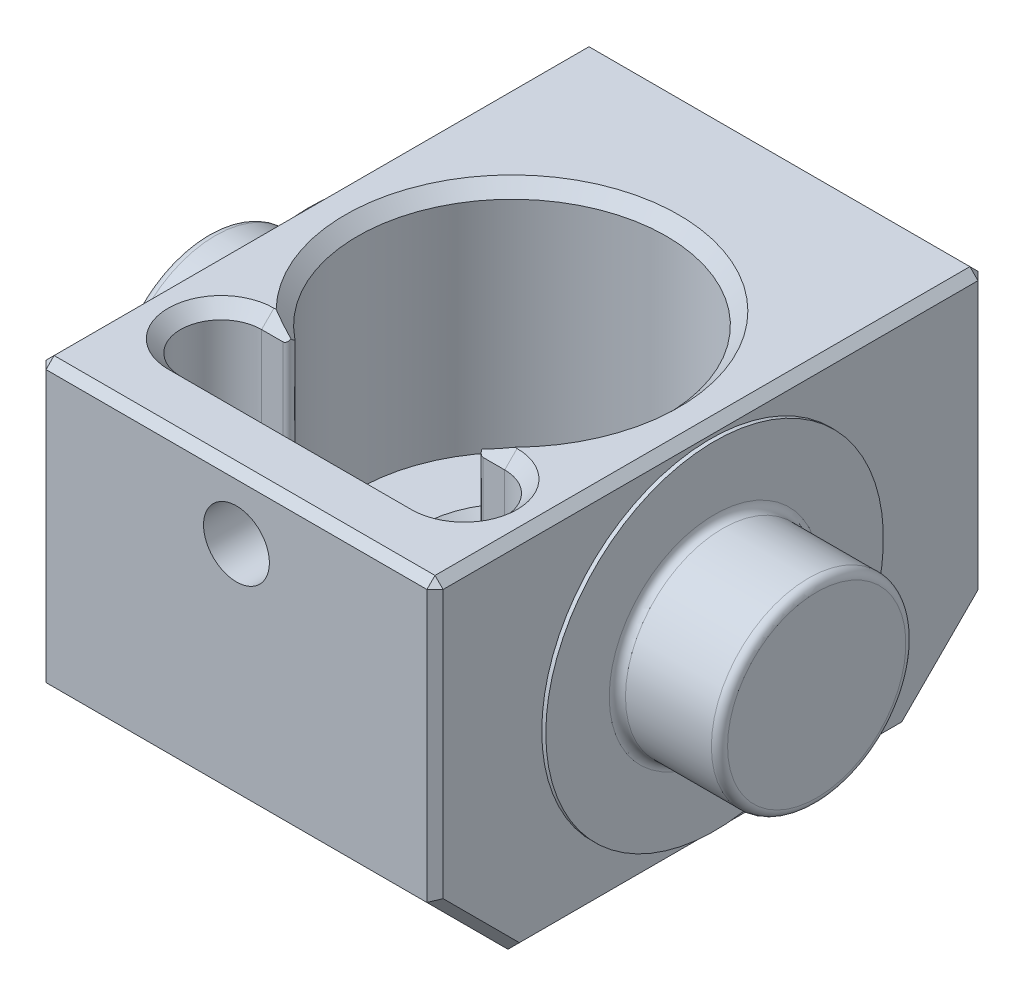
ISO-10303-21;
HEADER;
FILE_DESCRIPTION(('STEP AP214'),'2;1');
FILE_NAME('part.step','',(''),(''),'','','');
FILE_SCHEMA(('AUTOMOTIVE_DESIGN { 1 0 10303 214 1 1 1 1 }'));
ENDSEC;
DATA;
#1=APPLICATION_CONTEXT('core data for automotive mechanical design processes');
#2=APPLICATION_PROTOCOL_DEFINITION('international standard','automotive_design',2000,#1);
#3=PRODUCT_CONTEXT('',#1,'mechanical');
#4=PRODUCT('Part','Part','',(#3));
#5=PRODUCT_RELATED_PRODUCT_CATEGORY('part','',(#4));
#6=PRODUCT_DEFINITION_FORMATION('','',#4);
#7=PRODUCT_DEFINITION_CONTEXT('part definition',#1,'design');
#8=PRODUCT_DEFINITION('design','',#6,#7);
#9=PRODUCT_DEFINITION_SHAPE('','',#8);
#10=(LENGTH_UNIT() NAMED_UNIT(*) SI_UNIT(.MILLI.,.METRE.));
#11=(NAMED_UNIT(*) PLANE_ANGLE_UNIT() SI_UNIT($,.RADIAN.));
#12=(NAMED_UNIT(*) SI_UNIT($,.STERADIAN.) SOLID_ANGLE_UNIT());
#13=UNCERTAINTY_MEASURE_WITH_UNIT(LENGTH_MEASURE(1.E-05),#10,'distance_accuracy_value','');
#14=(GEOMETRIC_REPRESENTATION_CONTEXT(3) GLOBAL_UNCERTAINTY_ASSIGNED_CONTEXT((#13)) GLOBAL_UNIT_ASSIGNED_CONTEXT((#10,
#11,#12)) REPRESENTATION_CONTEXT('',''));
#15=CARTESIAN_POINT('',(0.,0.,0.));
#16=DIRECTION('',(0.,0.,1.));
#17=DIRECTION('',(1.,0.,0.));
#18=AXIS2_PLACEMENT_3D('',#15,#16,#17);
#19=CARTESIAN_POINT('',(-12.25,0.,0.));
#20=DIRECTION('',(1.,0.,0.));
#21=DIRECTION('',(0.,0.,-1.));
#22=AXIS2_PLACEMENT_3D('',#19,#20,#21);
#23=PLANE('',#22);
#24=DIRECTION('',(0.,0.707106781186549,0.707106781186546));
#25=VECTOR('',#24,1.);
#26=CARTESIAN_POINT('',(-12.25,-5.75894660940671,16.6464466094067));
#27=LINE('',#26,#25);
#28=CARTESIAN_POINT('',(-12.25,-10.6125,11.7928932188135));
#29=VERTEX_POINT('',#28);
#30=CARTESIAN_POINT('',(-12.25,-5.90539321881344,16.5));
#31=VERTEX_POINT('',#30);
#32=EDGE_CURVE('E323',#29,#31,#27,.T.);
#33=ORIENTED_EDGE('',*,*,#32,.T.);
#34=DIRECTION('',(0.,1.,0.));
#35=VECTOR('',#34,1.);
#36=CARTESIAN_POINT('',(-12.25,0.,16.5));
#37=LINE('',#36,#35);
#38=CARTESIAN_POINT('',(-12.25,10.6125,16.5));
#39=VERTEX_POINT('',#38);
#40=EDGE_CURVE('E325',#31,#39,#37,.T.);
#41=ORIENTED_EDGE('',*,*,#40,.T.);
#42=DIRECTION('',(0.,0.,-1.));
#43=VECTOR('',#42,1.);
#44=CARTESIAN_POINT('',(-12.25,10.6125,0.));
#45=LINE('',#44,#43);
#46=CARTESIAN_POINT('',(-12.25,10.6125,-16.5));
#47=VERTEX_POINT('',#46);
#48=EDGE_CURVE('E315',#39,#47,#45,.T.);
#49=ORIENTED_EDGE('',*,*,#48,.T.);
#50=DIRECTION('',(0.,-1.,0.));
#51=VECTOR('',#50,1.);
#52=CARTESIAN_POINT('',(-12.25,0.,-16.5));
#53=LINE('',#52,#51);
#54=CARTESIAN_POINT('',(-12.25,-5.90539321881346,-16.5));
#55=VERTEX_POINT('',#54);
#56=EDGE_CURVE('E317',#47,#55,#53,.T.);
#57=ORIENTED_EDGE('',*,*,#56,.T.);
#58=DIRECTION('',(0.,-0.707106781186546,0.707106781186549));
#59=VECTOR('',#58,1.);
#60=CARTESIAN_POINT('',(-12.25,-10.7589466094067,-11.6464466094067));
#61=LINE('',#60,#59);
#62=CARTESIAN_POINT('',(-12.25,-10.6125,-11.7928932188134));
#63=VERTEX_POINT('',#62);
#64=EDGE_CURVE('E319',#55,#63,#61,.T.);
#65=ORIENTED_EDGE('',*,*,#64,.T.);
#66=DIRECTION('',(0.,0.,1.));
#67=VECTOR('',#66,1.);
#68=CARTESIAN_POINT('',(-12.25,-10.6125,0.));
#69=LINE('',#68,#67);
#70=EDGE_CURVE('E321',#63,#29,#69,.T.);
#71=ORIENTED_EDGE('',*,*,#70,.T.);
#72=EDGE_LOOP('',(#33,#41,#49,#57,#65,#71));
#73=FACE_BOUND('',#72,.T.);
#74=CARTESIAN_POINT('',(-12.25,0.,0.));
#75=DIRECTION('',(1.,0.,0.));
#76=DIRECTION('',(0.,0.,-1.));
#77=AXIS2_PLACEMENT_3D('',#74,#75,#76);
#78=CIRCLE('',#77,10.414);
#79=CARTESIAN_POINT('',(-12.25,0.,-10.414));
#80=VERTEX_POINT('',#79);
#81=EDGE_CURVE('E260',#80,#80,#78,.F.);
#82=ORIENTED_EDGE('',*,*,#81,.F.);
#83=EDGE_LOOP('',(#82));
#84=FACE_BOUND('',#83,.T.);
#85=ADVANCED_FACE('F32',(#73,#84),#23,.F.);
#86=CARTESIAN_POINT('',(12.25,0.,0.));
#87=DIRECTION('',(1.,0.,0.));
#88=DIRECTION('',(0.,0.,-1.));
#89=AXIS2_PLACEMENT_3D('',#86,#87,#88);
#90=PLANE('',#89);
#91=DIRECTION('',(0.,-1.,0.));
#92=VECTOR('',#91,1.);
#93=CARTESIAN_POINT('',(12.25,-6.11249999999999,16.5));
#94=LINE('',#93,#92);
#95=CARTESIAN_POINT('',(12.25,10.6125,16.5));
#96=VERTEX_POINT('',#95);
#97=CARTESIAN_POINT('',(12.25,-5.90539321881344,16.5));
#98=VERTEX_POINT('',#97);
#99=EDGE_CURVE('E285',#96,#98,#94,.T.);
#100=ORIENTED_EDGE('',*,*,#99,.T.);
#101=DIRECTION('',(0.,-0.707106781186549,-0.707106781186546));
#102=VECTOR('',#101,1.);
#103=CARTESIAN_POINT('',(12.25,-11.2026966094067,11.2026966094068));
#104=LINE('',#103,#102);
#105=CARTESIAN_POINT('',(12.25,-10.6125,11.7928932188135));
#106=VERTEX_POINT('',#105);
#107=EDGE_CURVE('E287',#98,#106,#104,.T.);
#108=ORIENTED_EDGE('',*,*,#107,.T.);
#109=DIRECTION('',(0.,0.,-1.));
#110=VECTOR('',#109,1.);
#111=CARTESIAN_POINT('',(12.25,-10.6125,-12.));
#112=LINE('',#111,#110);
#113=CARTESIAN_POINT('',(12.25,-10.6125,-11.7928932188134));
#114=VERTEX_POINT('',#113);
#115=EDGE_CURVE('E283',#106,#114,#112,.T.);
#116=ORIENTED_EDGE('',*,*,#115,.T.);
#117=DIRECTION('',(0.,0.707106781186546,-0.707106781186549));
#118=VECTOR('',#117,1.);
#119=CARTESIAN_POINT('',(12.25,-11.2026966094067,-11.2026966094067));
#120=LINE('',#119,#118);
#121=CARTESIAN_POINT('',(12.25,-5.90539321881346,-16.5));
#122=VERTEX_POINT('',#121);
#123=EDGE_CURVE('E281',#114,#122,#120,.T.);
#124=ORIENTED_EDGE('',*,*,#123,.T.);
#125=DIRECTION('',(0.,1.,0.));
#126=VECTOR('',#125,1.);
#127=CARTESIAN_POINT('',(12.25,11.1125,-16.5));
#128=LINE('',#127,#126);
#129=CARTESIAN_POINT('',(12.25,10.6125,-16.5));
#130=VERTEX_POINT('',#129);
#131=EDGE_CURVE('E279',#122,#130,#128,.T.);
#132=ORIENTED_EDGE('',*,*,#131,.T.);
#133=DIRECTION('',(0.,0.,1.));
#134=VECTOR('',#133,1.);
#135=CARTESIAN_POINT('',(12.25,10.6125,17.));
#136=LINE('',#135,#134);
#137=EDGE_CURVE('E277',#130,#96,#136,.T.);
#138=ORIENTED_EDGE('',*,*,#137,.T.);
#139=EDGE_LOOP('',(#100,#108,#116,#124,#132,#138));
#140=FACE_BOUND('',#139,.T.);
#141=CARTESIAN_POINT('',(12.25,0.,0.));
#142=DIRECTION('',(-1.,0.,0.));
#143=DIRECTION('',(0.,0.,1.));
#144=AXIS2_PLACEMENT_3D('',#141,#142,#143);
#145=CIRCLE('',#144,10.414);
#146=CARTESIAN_POINT('',(12.25,0.,10.414));
#147=VERTEX_POINT('',#146);
#148=EDGE_CURVE('E257',#147,#147,#145,.T.);
#149=ORIENTED_EDGE('',*,*,#148,.T.);
#150=EDGE_LOOP('',(#149));
#151=FACE_BOUND('',#150,.T.);
#152=ADVANCED_FACE('F536',(#140,#151),#90,.T.);
#153=CARTESIAN_POINT('',(12.25,11.1125,-17.));
#154=DIRECTION('',(0.,0.,1.));
#155=DIRECTION('',(0.,-1.,0.));
#156=AXIS2_PLACEMENT_3D('',#153,#154,#155);
#157=PLANE('',#156);
#158=DIRECTION('',(1.,0.,0.));
#159=VECTOR('',#158,1.);
#160=CARTESIAN_POINT('',(12.25,10.6125,-17.));
#161=LINE('',#160,#159);
#162=CARTESIAN_POINT('',(-11.75,10.6125,-17.));
#163=VERTEX_POINT('',#162);
#164=CARTESIAN_POINT('',(11.75,10.6125,-17.));
#165=VERTEX_POINT('',#164);
#166=EDGE_CURVE('E309',#163,#165,#161,.T.);
#167=ORIENTED_EDGE('',*,*,#166,.T.);
#168=DIRECTION('',(0.,-1.,0.));
#169=VECTOR('',#168,1.);
#170=CARTESIAN_POINT('',(11.75,-6.1125,-17.));
#171=LINE('',#170,#169);
#172=CARTESIAN_POINT('',(11.75,-6.1125,-17.));
#173=VERTEX_POINT('',#172);
#174=EDGE_CURVE('E313',#165,#173,#171,.T.);
#175=ORIENTED_EDGE('',*,*,#174,.T.);
#176=DIRECTION('',(-1.,0.,0.));
#177=VECTOR('',#176,1.);
#178=CARTESIAN_POINT('',(12.25,-6.1125,-17.));
#179=LINE('',#178,#177);
#180=CARTESIAN_POINT('',(-11.75,-6.1125,-17.));
#181=VERTEX_POINT('',#180);
#182=EDGE_CURVE('E265',#173,#181,#179,.T.);
#183=ORIENTED_EDGE('',*,*,#182,.T.);
#184=DIRECTION('',(0.,1.,0.));
#185=VECTOR('',#184,1.);
#186=CARTESIAN_POINT('',(-11.75,11.1125,-17.));
#187=LINE('',#186,#185);
#188=EDGE_CURVE('E311',#181,#163,#187,.T.);
#189=ORIENTED_EDGE('',*,*,#188,.T.);
#190=EDGE_LOOP('',(#167,#175,#183,#189));
#191=FACE_BOUND('',#190,.T.);
#192=ADVANCED_FACE('F542',(#191),#157,.F.);
#193=CARTESIAN_POINT('',(12.25,11.1125,17.));
#194=DIRECTION('',(0.,-1.,0.));
#195=DIRECTION('',(0.,0.,-1.));
#196=AXIS2_PLACEMENT_3D('',#193,#194,#195);
#197=PLANE('',#196);
#198=CARTESIAN_POINT('',(7.5,11.1125,10.44893));
#199=DIRECTION('',(0.,-1.,0.));
#200=DIRECTION('',(0.,0.,-1.));
#201=AXIS2_PLACEMENT_3D('',#198,#199,#200);
#202=CIRCLE('',#201,3.26200000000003);
#203=CARTESIAN_POINT('',(7.5,11.1125,7.18692999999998));
#204=VERTEX_POINT('',#203);
#205=CARTESIAN_POINT('',(7.5,11.1125,13.71093));
#206=VERTEX_POINT('',#205);
#207=EDGE_CURVE('E402',#204,#206,#202,.T.);
#208=ORIENTED_EDGE('',*,*,#207,.T.);
#209=DIRECTION('',(-1.,0.,0.));
#210=VECTOR('',#209,1.);
#211=CARTESIAN_POINT('',(12.25,11.1125,13.71093));
#212=LINE('',#211,#210);
#213=CARTESIAN_POINT('',(-7.5,11.1125,13.71093));
#214=VERTEX_POINT('',#213);
#215=EDGE_CURVE('E404',#206,#214,#212,.T.);
#216=ORIENTED_EDGE('',*,*,#215,.T.);
#217=CARTESIAN_POINT('',(-7.5,11.1125,10.44893));
#218=DIRECTION('',(0.,-1.,0.));
#219=DIRECTION('',(0.,0.,-1.));
#220=AXIS2_PLACEMENT_3D('',#217,#218,#219);
#221=CIRCLE('',#220,3.26200000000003);
#222=CARTESIAN_POINT('',(-7.5,11.1125,7.18692999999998));
#223=VERTEX_POINT('',#222);
#224=EDGE_CURVE('E393',#214,#223,#221,.T.);
#225=ORIENTED_EDGE('',*,*,#224,.T.);
#226=DIRECTION('',(1.,0.,0.));
#227=VECTOR('',#226,1.);
#228=CARTESIAN_POINT('',(12.25,11.1125,7.18692999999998));
#229=LINE('',#228,#227);
#230=CARTESIAN_POINT('',(-7.36537898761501,11.1125,7.18692999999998));
#231=VERTEX_POINT('',#230);
#232=EDGE_CURVE('E395',#223,#231,#229,.T.);
#233=ORIENTED_EDGE('',*,*,#232,.T.);
#234=CARTESIAN_POINT('',(0.,11.1125,0.));
#235=DIRECTION('',(0.,-1.,0.));
#236=DIRECTION('',(0.,0.,-1.));
#237=AXIS2_PLACEMENT_3D('',#234,#235,#236);
#238=CIRCLE('',#237,10.29081);
#239=CARTESIAN_POINT('',(7.36537898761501,11.1125,7.18692999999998));
#240=VERTEX_POINT('',#239);
#241=EDGE_CURVE('E398',#231,#240,#238,.T.);
#242=ORIENTED_EDGE('',*,*,#241,.T.);
#243=DIRECTION('',(1.,0.,0.));
#244=VECTOR('',#243,1.);
#245=CARTESIAN_POINT('',(12.25,11.1125,7.18692999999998));
#246=LINE('',#245,#244);
#247=EDGE_CURVE('E400',#240,#204,#246,.T.);
#248=ORIENTED_EDGE('',*,*,#247,.T.);
#249=EDGE_LOOP('',(#208,#216,#225,#233,#242,#248));
#250=FACE_BOUND('',#249,.T.);
#251=DIRECTION('',(0.,0.,-1.));
#252=VECTOR('',#251,1.);
#253=CARTESIAN_POINT('',(11.75,11.1125,-17.));
#254=LINE('',#253,#252);
#255=CARTESIAN_POINT('',(11.75,11.1125,16.5));
#256=VERTEX_POINT('',#255);
#257=CARTESIAN_POINT('',(11.75,11.1125,-16.5));
#258=VERTEX_POINT('',#257);
#259=EDGE_CURVE('E332',#256,#258,#254,.T.);
#260=ORIENTED_EDGE('',*,*,#259,.T.);
#261=DIRECTION('',(-1.,0.,0.));
#262=VECTOR('',#261,1.);
#263=CARTESIAN_POINT('',(12.25,11.1125,-16.5));
#264=LINE('',#263,#262);
#265=CARTESIAN_POINT('',(-11.75,11.1125,-16.5));
#266=VERTEX_POINT('',#265);
#267=EDGE_CURVE('E334',#258,#266,#264,.T.);
#268=ORIENTED_EDGE('',*,*,#267,.T.);
#269=DIRECTION('',(0.,0.,1.));
#270=VECTOR('',#269,1.);
#271=CARTESIAN_POINT('',(-11.75,11.1125,17.));
#272=LINE('',#271,#270);
#273=CARTESIAN_POINT('',(-11.75,11.1125,16.5));
#274=VERTEX_POINT('',#273);
#275=EDGE_CURVE('E328',#266,#274,#272,.T.);
#276=ORIENTED_EDGE('',*,*,#275,.T.);
#277=DIRECTION('',(1.,0.,0.));
#278=VECTOR('',#277,1.);
#279=CARTESIAN_POINT('',(12.25,11.1125,16.5));
#280=LINE('',#279,#278);
#281=EDGE_CURVE('E330',#274,#256,#280,.T.);
#282=ORIENTED_EDGE('',*,*,#281,.T.);
#283=EDGE_LOOP('',(#260,#268,#276,#282));
#284=FACE_BOUND('',#283,.T.);
#285=ADVANCED_FACE('F556',(#250,#284),#197,.F.);
#286=CARTESIAN_POINT('',(12.25,11.1125,17.));
#287=DIRECTION('',(0.,0.,-1.));
#288=DIRECTION('',(0.,1.,0.));
#289=AXIS2_PLACEMENT_3D('',#286,#287,#288);
#290=PLANE('',#289);
#291=CARTESIAN_POINT('',(0.,7.1725,17.));
#292=DIRECTION('',(0.,0.,1.));
#293=DIRECTION('',(1.,0.,0.));
#294=AXIS2_PLACEMENT_3D('',#291,#292,#293);
#295=CIRCLE('',#294,2.032);
#296=CARTESIAN_POINT('',(2.032,7.1725,17.));
#297=VERTEX_POINT('',#296);
#298=EDGE_CURVE('E236',#297,#297,#295,.T.);
#299=ORIENTED_EDGE('',*,*,#298,.F.);
#300=EDGE_LOOP('',(#299));
#301=FACE_BOUND('',#300,.T.);
#302=DIRECTION('',(1.,0.,0.));
#303=VECTOR('',#302,1.);
#304=CARTESIAN_POINT('',(12.25,-6.11249999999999,17.));
#305=LINE('',#304,#303);
#306=CARTESIAN_POINT('',(-11.75,-6.11249999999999,17.));
#307=VERTEX_POINT('',#306);
#308=CARTESIAN_POINT('',(11.75,-6.11249999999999,17.));
#309=VERTEX_POINT('',#308);
#310=EDGE_CURVE('E274',#307,#309,#305,.T.);
#311=ORIENTED_EDGE('',*,*,#310,.T.);
#312=DIRECTION('',(0.,1.,0.));
#313=VECTOR('',#312,1.);
#314=CARTESIAN_POINT('',(11.75,11.1125,17.));
#315=LINE('',#314,#313);
#316=CARTESIAN_POINT('',(11.75,10.6125,17.));
#317=VERTEX_POINT('',#316);
#318=EDGE_CURVE('E299',#309,#317,#315,.T.);
#319=ORIENTED_EDGE('',*,*,#318,.T.);
#320=DIRECTION('',(-1.,0.,0.));
#321=VECTOR('',#320,1.);
#322=CARTESIAN_POINT('',(12.25,10.6125,17.));
#323=LINE('',#322,#321);
#324=CARTESIAN_POINT('',(-11.75,10.6125,17.));
#325=VERTEX_POINT('',#324);
#326=EDGE_CURVE('E295',#317,#325,#323,.T.);
#327=ORIENTED_EDGE('',*,*,#326,.T.);
#328=DIRECTION('',(0.,-1.,0.));
#329=VECTOR('',#328,1.);
#330=CARTESIAN_POINT('',(-11.75,11.1125,17.));
#331=LINE('',#330,#329);
#332=EDGE_CURVE('E297',#325,#307,#331,.T.);
#333=ORIENTED_EDGE('',*,*,#332,.T.);
#334=EDGE_LOOP('',(#311,#319,#327,#333));
#335=FACE_BOUND('',#334,.T.);
#336=ADVANCED_FACE('F552',(#301,#335),#290,.F.);
#337=CARTESIAN_POINT('',(12.25,-11.1125,17.));
#338=DIRECTION('',(0.,1.,0.));
#339=DIRECTION('',(0.,0.,1.));
#340=AXIS2_PLACEMENT_3D('',#337,#338,#339);
#341=PLANE('',#340);
#342=CARTESIAN_POINT('',(0.,-11.1125,0.));
#343=DIRECTION('',(0.,1.,0.));
#344=DIRECTION('',(0.,0.,1.));
#345=AXIS2_PLACEMENT_3D('',#342,#343,#344);
#346=CIRCLE('',#345,5.65619999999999);
#347=CARTESIAN_POINT('',(0.,-11.1125,5.65619999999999));
#348=VERTEX_POINT('',#347);
#349=EDGE_CURVE('E496',#348,#348,#346,.T.);
#350=ORIENTED_EDGE('',*,*,#349,.T.);
#351=EDGE_LOOP('',(#350));
#352=FACE_BOUND('',#351,.T.);
#353=DIRECTION('',(1.,0.,0.));
#354=VECTOR('',#353,1.);
#355=CARTESIAN_POINT('',(12.25,-11.1125,-12.));
#356=LINE('',#355,#354);
#357=CARTESIAN_POINT('',(-11.75,-11.1125,-12.));
#358=VERTEX_POINT('',#357);
#359=CARTESIAN_POINT('',(11.75,-11.1125,-12.));
#360=VERTEX_POINT('',#359);
#361=EDGE_CURVE('E271',#358,#360,#356,.T.);
#362=ORIENTED_EDGE('',*,*,#361,.T.);
#363=DIRECTION('',(0.,0.,1.));
#364=VECTOR('',#363,1.);
#365=CARTESIAN_POINT('',(11.75,-11.1125,12.));
#366=LINE('',#365,#364);
#367=CARTESIAN_POINT('',(11.75,-11.1125,12.));
#368=VERTEX_POINT('',#367);
#369=EDGE_CURVE('E303',#360,#368,#366,.T.);
#370=ORIENTED_EDGE('',*,*,#369,.T.);
#371=DIRECTION('',(-1.,0.,0.));
#372=VECTOR('',#371,1.);
#373=CARTESIAN_POINT('',(12.25,-11.1125,12.));
#374=LINE('',#373,#372);
#375=CARTESIAN_POINT('',(-11.75,-11.1125,12.));
#376=VERTEX_POINT('',#375);
#377=EDGE_CURVE('E268',#368,#376,#374,.T.);
#378=ORIENTED_EDGE('',*,*,#377,.T.);
#379=DIRECTION('',(0.,0.,-1.));
#380=VECTOR('',#379,1.);
#381=CARTESIAN_POINT('',(-11.75,-11.1125,17.));
#382=LINE('',#381,#380);
#383=EDGE_CURVE('E301',#376,#358,#382,.T.);
#384=ORIENTED_EDGE('',*,*,#383,.T.);
#385=EDGE_LOOP('',(#362,#370,#378,#384));
#386=FACE_BOUND('',#385,.T.);
#387=ADVANCED_FACE('F548',(#352,#386),#341,.F.);
#388=CARTESIAN_POINT('',(0.,0.,0.));
#389=DIRECTION('',(-1.,0.,0.));
#390=DIRECTION('',(0.,0.,1.));
#391=AXIS2_PLACEMENT_3D('',#388,#389,#390);
#392=CYLINDRICAL_SURFACE('',#391,10.414);
#393=ORIENTED_EDGE('',*,*,#148,.F.);
#394=EDGE_LOOP('',(#393));
#395=FACE_BOUND('',#394,.T.);
#396=CARTESIAN_POINT('',(12.5,0.,0.));
#397=DIRECTION('',(-1.,0.,0.));
#398=DIRECTION('',(0.,0.,1.));
#399=AXIS2_PLACEMENT_3D('',#396,#397,#398);
#400=CIRCLE('',#399,10.414);
#401=CARTESIAN_POINT('',(12.5,0.,10.414));
#402=VERTEX_POINT('',#401);
#403=EDGE_CURVE('E254',#402,#402,#400,.T.);
#404=ORIENTED_EDGE('',*,*,#403,.T.);
#405=EDGE_LOOP('',(#404));
#406=FACE_BOUND('',#405,.T.);
#407=ADVANCED_FACE('F551',(#395,#406),#392,.T.);
#408=CARTESIAN_POINT('',(12.5,10.414,0.));
#409=DIRECTION('',(-1.,0.,0.));
#410=DIRECTION('',(0.,0.,1.));
#411=AXIS2_PLACEMENT_3D('',#408,#409,#410);
#412=PLANE('',#411);
#413=CARTESIAN_POINT('',(12.5,0.,0.));
#414=DIRECTION('',(-1.,0.,0.));
#415=DIRECTION('',(0.,0.,1.));
#416=AXIS2_PLACEMENT_3D('',#413,#414,#415);
#417=CIRCLE('',#416,6.500000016);
#418=CARTESIAN_POINT('',(12.5,0.,6.500000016));
#419=VERTEX_POINT('',#418);
#420=EDGE_CURVE('E511',#419,#419,#417,.T.);
#421=ORIENTED_EDGE('',*,*,#420,.T.);
#422=EDGE_LOOP('',(#421));
#423=FACE_BOUND('',#422,.T.);
#424=ORIENTED_EDGE('',*,*,#403,.F.);
#425=EDGE_LOOP('',(#424));
#426=FACE_BOUND('',#425,.T.);
#427=ADVANCED_FACE('F724',(#423,#426),#412,.F.);
#428=CARTESIAN_POINT('',(0.,0.,0.));
#429=DIRECTION('',(-1.,0.,0.));
#430=DIRECTION('',(0.,0.,1.));
#431=AXIS2_PLACEMENT_3D('',#428,#429,#430);
#432=CYLINDRICAL_SURFACE('',#431,6.);
#433=CARTESIAN_POINT('',(13.000000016,0.,0.));
#434=DIRECTION('',(-1.,0.,0.));
#435=DIRECTION('',(0.,0.,1.));
#436=AXIS2_PLACEMENT_3D('',#433,#434,#435);
#437=CIRCLE('',#436,6.);
#438=CARTESIAN_POINT('',(13.000000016,0.,6.));
#439=VERTEX_POINT('',#438);
#440=EDGE_CURVE('E514',#439,#439,#437,.F.);
#441=ORIENTED_EDGE('',*,*,#440,.T.);
#442=EDGE_LOOP('',(#441));
#443=FACE_BOUND('',#442,.T.);
#444=CARTESIAN_POINT('',(18.299999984,0.,0.));
#445=DIRECTION('',(-1.,0.,0.));
#446=DIRECTION('',(0.,0.,1.));
#447=AXIS2_PLACEMENT_3D('',#444,#445,#446);
#448=CIRCLE('',#447,6.);
#449=CARTESIAN_POINT('',(18.299999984,0.,6.));
#450=VERTEX_POINT('',#449);
#451=EDGE_CURVE('E505',#450,#450,#448,.T.);
#452=ORIENTED_EDGE('',*,*,#451,.T.);
#453=EDGE_LOOP('',(#452));
#454=FACE_BOUND('',#453,.T.);
#455=ADVANCED_FACE('F720',(#443,#454),#432,.T.);
#456=CARTESIAN_POINT('',(18.8,6.,0.));
#457=DIRECTION('',(-1.,0.,0.));
#458=DIRECTION('',(0.,0.,1.));
#459=AXIS2_PLACEMENT_3D('',#456,#457,#458);
#460=PLANE('',#459);
#461=CARTESIAN_POINT('',(18.8,0.,0.));
#462=DIRECTION('',(-1.,0.,0.));
#463=DIRECTION('',(0.,0.,1.));
#464=AXIS2_PLACEMENT_3D('',#461,#462,#463);
#465=CIRCLE('',#464,5.499999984);
#466=CARTESIAN_POINT('',(18.8,0.,5.499999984));
#467=VERTEX_POINT('',#466);
#468=EDGE_CURVE('E508',#467,#467,#465,.F.);
#469=ORIENTED_EDGE('',*,*,#468,.T.);
#470=EDGE_LOOP('',(#469));
#471=FACE_BOUND('',#470,.T.);
#472=ADVANCED_FACE('F716',(#471),#460,.F.);
#473=CARTESIAN_POINT('',(0.,0.,0.));
#474=DIRECTION('',(1.,0.,0.));
#475=DIRECTION('',(0.,0.,1.));
#476=AXIS2_PLACEMENT_3D('',#473,#474,#475);
#477=CYLINDRICAL_SURFACE('',#476,10.414);
#478=ORIENTED_EDGE('',*,*,#81,.T.);
#479=EDGE_LOOP('',(#478));
#480=FACE_BOUND('',#479,.T.);
#481=CARTESIAN_POINT('',(-12.5,0.,0.));
#482=DIRECTION('',(-1.,0.,0.));
#483=DIRECTION('',(0.,0.,1.));
#484=AXIS2_PLACEMENT_3D('',#481,#482,#483);
#485=CIRCLE('',#484,10.414);
#486=CARTESIAN_POINT('',(-12.5,0.,10.414));
#487=VERTEX_POINT('',#486);
#488=EDGE_CURVE('E251',#487,#487,#485,.T.);
#489=ORIENTED_EDGE('',*,*,#488,.F.);
#490=EDGE_LOOP('',(#489));
#491=FACE_BOUND('',#490,.T.);
#492=ADVANCED_FACE('F712',(#480,#491),#477,.T.);
#493=CARTESIAN_POINT('',(-12.5,10.414,0.));
#494=DIRECTION('',(1.,0.,0.));
#495=DIRECTION('',(0.,0.,1.));
#496=AXIS2_PLACEMENT_3D('',#493,#494,#495);
#497=PLANE('',#496);
#498=CARTESIAN_POINT('',(-12.5,0.,0.));
#499=DIRECTION('',(1.,0.,0.));
#500=DIRECTION('',(0.,0.,-1.));
#501=AXIS2_PLACEMENT_3D('',#498,#499,#500);
#502=CIRCLE('',#501,6.500000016);
#503=CARTESIAN_POINT('',(-12.5,0.,-6.500000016));
#504=VERTEX_POINT('',#503);
#505=EDGE_CURVE('E11',#504,#504,#502,.T.);
#506=ORIENTED_EDGE('',*,*,#505,.T.);
#507=EDGE_LOOP('',(#506));
#508=FACE_BOUND('',#507,.T.);
#509=ORIENTED_EDGE('',*,*,#488,.T.);
#510=EDGE_LOOP('',(#509));
#511=FACE_BOUND('',#510,.T.);
#512=ADVANCED_FACE('F709',(#508,#511),#497,.F.);
#513=CARTESIAN_POINT('',(0.,0.,0.));
#514=DIRECTION('',(1.,0.,0.));
#515=DIRECTION('',(0.,0.,1.));
#516=AXIS2_PLACEMENT_3D('',#513,#514,#515);
#517=CYLINDRICAL_SURFACE('',#516,6.);
#518=CARTESIAN_POINT('',(-13.000000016,0.,0.));
#519=DIRECTION('',(1.,0.,0.));
#520=DIRECTION('',(0.,0.,-1.));
#521=AXIS2_PLACEMENT_3D('',#518,#519,#520);
#522=CIRCLE('',#521,6.);
#523=CARTESIAN_POINT('',(-13.000000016,0.,-6.));
#524=VERTEX_POINT('',#523);
#525=EDGE_CURVE('E40',#524,#524,#522,.F.);
#526=ORIENTED_EDGE('',*,*,#525,.T.);
#527=EDGE_LOOP('',(#526));
#528=FACE_BOUND('',#527,.T.);
#529=CARTESIAN_POINT('',(-18.299999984,0.,0.));
#530=DIRECTION('',(1.,0.,0.));
#531=DIRECTION('',(0.,0.,-1.));
#532=AXIS2_PLACEMENT_3D('',#529,#530,#531);
#533=CIRCLE('',#532,6.);
#534=CARTESIAN_POINT('',(-18.299999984,0.,-6.));
#535=VERTEX_POINT('',#534);
#536=EDGE_CURVE('E502',#535,#535,#533,.T.);
#537=ORIENTED_EDGE('',*,*,#536,.T.);
#538=EDGE_LOOP('',(#537));
#539=FACE_BOUND('',#538,.T.);
#540=ADVANCED_FACE('F519',(#528,#539),#517,.T.);
#541=CARTESIAN_POINT('',(-18.8,6.,0.));
#542=DIRECTION('',(1.,0.,0.));
#543=DIRECTION('',(0.,0.,1.));
#544=AXIS2_PLACEMENT_3D('',#541,#542,#543);
#545=PLANE('',#544);
#546=CARTESIAN_POINT('',(-18.8,0.,0.));
#547=DIRECTION('',(1.,0.,0.));
#548=DIRECTION('',(0.,0.,-1.));
#549=AXIS2_PLACEMENT_3D('',#546,#547,#548);
#550=CIRCLE('',#549,5.499999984);
#551=CARTESIAN_POINT('',(-18.8,0.,-5.499999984));
#552=VERTEX_POINT('',#551);
#553=EDGE_CURVE('E499',#552,#552,#550,.F.);
#554=ORIENTED_EDGE('',*,*,#553,.T.);
#555=EDGE_LOOP('',(#554));
#556=FACE_BOUND('',#555,.T.);
#557=ADVANCED_FACE('F697',(#556),#545,.F.);
#558=CARTESIAN_POINT('',(0.,-3.175,0.));
#559=DIRECTION('',(0.,-1.,0.));
#560=DIRECTION('',(0.,0.,-1.));
#561=AXIS2_PLACEMENT_3D('',#558,#559,#560);
#562=PLANE('',#561);
#563=CARTESIAN_POINT('',(0.,-3.175,0.));
#564=DIRECTION('',(0.,-1.,0.));
#565=DIRECTION('',(0.,0.,-1.));
#566=AXIS2_PLACEMENT_3D('',#563,#564,#565);
#567=CIRCLE('',#566,5.65620000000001);
#568=CARTESIAN_POINT('',(0.,-3.175,-5.65620000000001));
#569=VERTEX_POINT('',#568);
#570=EDGE_CURVE('E493',#569,#569,#567,.T.);
#571=ORIENTED_EDGE('',*,*,#570,.T.);
#572=EDGE_LOOP('',(#571));
#573=FACE_BOUND('',#572,.T.);
#574=CARTESIAN_POINT('',(0.,-3.175,0.));
#575=DIRECTION('',(0.,1.,0.));
#576=DIRECTION('',(0.,0.,1.));
#577=AXIS2_PLACEMENT_3D('',#574,#575,#576);
#578=CIRCLE('',#577,9.52881);
#579=CARTESIAN_POINT('',(0.,-3.175,9.52881));
#580=VERTEX_POINT('',#579);
#581=EDGE_CURVE('E244',#580,#580,#578,.T.);
#582=ORIENTED_EDGE('',*,*,#581,.T.);
#583=EDGE_LOOP('',(#582));
#584=FACE_BOUND('',#583,.T.);
#585=ADVANCED_FACE('F692',(#573,#584),#562,.F.);
#586=CARTESIAN_POINT('',(0.,10.1246822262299,0.));
#587=DIRECTION('',(0.,1.,0.));
#588=DIRECTION('',(0.,0.,1.));
#589=AXIS2_PLACEMENT_3D('',#586,#587,#588);
#590=CYLINDRICAL_SURFACE('',#589,9.52880999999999);
#591=CARTESIAN_POINT('',(0.,4.6125,0.));
#592=DIRECTION('',(0.,1.,0.));
#593=DIRECTION('',(0.,0.,1.));
#594=AXIS2_PLACEMENT_3D('',#591,#592,#593);
#595=CIRCLE('',#594,9.52880999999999);
#596=CARTESIAN_POINT('',(5.98406990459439,4.6125,7.41546541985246));
#597=VERTEX_POINT('',#596);
#598=CARTESIAN_POINT('',(-5.98406990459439,4.6125,7.41546541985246));
#599=VERTEX_POINT('',#598);
#600=EDGE_CURVE('E263',#597,#599,#595,.F.);
#601=ORIENTED_EDGE('',*,*,#600,.F.);
#602=DIRECTION('',(0.,1.,0.));
#603=VECTOR('',#602,1.);
#604=CARTESIAN_POINT('',(5.98406990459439,10.1246822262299,7.41546541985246));
#605=LINE('',#604,#603);
#606=CARTESIAN_POINT('',(5.98406990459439,10.3505,7.41546541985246));
#607=VERTEX_POINT('',#606);
#608=EDGE_CURVE('E683',#597,#607,#605,.T.);
#609=ORIENTED_EDGE('',*,*,#608,.T.);
#610=CARTESIAN_POINT('',(0.,10.3505,0.));
#611=DIRECTION('',(0.,-1.,0.));
#612=DIRECTION('',(0.,0.,-1.));
#613=AXIS2_PLACEMENT_3D('',#610,#611,#612);
#614=CIRCLE('',#613,9.52880999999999);
#615=CARTESIAN_POINT('',(-5.98406990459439,10.3505,7.41546541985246));
#616=VERTEX_POINT('',#615);
#617=EDGE_CURVE('E412',#607,#616,#614,.F.);
#618=ORIENTED_EDGE('',*,*,#617,.T.);
#619=DIRECTION('',(0.,1.,0.));
#620=VECTOR('',#619,1.);
#621=CARTESIAN_POINT('',(-5.98406990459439,10.1246822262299,7.41546541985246));
#622=LINE('',#621,#620);
#623=EDGE_CURVE('E418',#616,#599,#622,.F.);
#624=ORIENTED_EDGE('',*,*,#623,.T.);
#625=EDGE_LOOP('',(#601,#609,#618,#624));
#626=FACE_BOUND('',#625,.T.);
#627=ORIENTED_EDGE('',*,*,#581,.F.);
#628=EDGE_LOOP('',(#627));
#629=FACE_BOUND('',#628,.T.);
#630=ADVANCED_FACE('F688',(#626,#629),#590,.F.);
#631=CARTESIAN_POINT('',(0.,-1.92521317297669,0.));
#632=DIRECTION('',(0.,1.,0.));
#633=DIRECTION('',(0.,0.,1.));
#634=AXIS2_PLACEMENT_3D('',#631,#632,#633);
#635=CYLINDRICAL_SURFACE('',#634,5.1562);
#636=CARTESIAN_POINT('',(0.,-3.67500000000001,0.));
#637=DIRECTION('',(0.,-1.,0.));
#638=DIRECTION('',(0.,0.,-1.));
#639=AXIS2_PLACEMENT_3D('',#636,#637,#638);
#640=CIRCLE('',#639,5.1562);
#641=CARTESIAN_POINT('',(0.,-3.67500000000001,-5.1562));
#642=VERTEX_POINT('',#641);
#643=EDGE_CURVE('E490',#642,#642,#640,.F.);
#644=ORIENTED_EDGE('',*,*,#643,.T.);
#645=EDGE_LOOP('',(#644));
#646=FACE_BOUND('',#645,.T.);
#647=CARTESIAN_POINT('',(0.,-10.6125,0.));
#648=DIRECTION('',(0.,1.,0.));
#649=DIRECTION('',(0.,0.,1.));
#650=AXIS2_PLACEMENT_3D('',#647,#648,#649);
#651=CIRCLE('',#650,5.1562);
#652=CARTESIAN_POINT('',(0.,-10.6125,5.1562));
#653=VERTEX_POINT('',#652);
#654=EDGE_CURVE('E487',#653,#653,#651,.F.);
#655=ORIENTED_EDGE('',*,*,#654,.T.);
#656=EDGE_LOOP('',(#655));
#657=FACE_BOUND('',#656,.T.);
#658=ADVANCED_FACE('F691',(#646,#657),#635,.F.);
#659=CARTESIAN_POINT('',(-7.5,4.6125,7.94893000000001));
#660=DIRECTION('',(0.,0.,-1.));
#661=DIRECTION('',(-1.,0.,0.));
#662=AXIS2_PLACEMENT_3D('',#659,#660,#661);
#663=PLANE('',#662);
#664=DIRECTION('',(-1.,0.,0.));
#665=VECTOR('',#664,1.);
#666=CARTESIAN_POINT('',(-7.5,4.6125,7.94893000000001));
#667=LINE('',#666,#665);
#668=CARTESIAN_POINT('',(-6.1724691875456,4.6125,7.94893000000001));
#669=VERTEX_POINT('',#668);
#670=CARTESIAN_POINT('',(-7.5,4.6125,7.94893000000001));
#671=VERTEX_POINT('',#670);
#672=EDGE_CURVE('E228',#669,#671,#667,.T.);
#673=ORIENTED_EDGE('',*,*,#672,.F.);
#674=DIRECTION('',(0.,1.,0.));
#675=VECTOR('',#674,1.);
#676=CARTESIAN_POINT('',(-6.1724691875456,4.6125,7.94893000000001));
#677=LINE('',#676,#675);
#678=CARTESIAN_POINT('',(-6.1724691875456,10.3505,7.94893000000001));
#679=VERTEX_POINT('',#678);
#680=EDGE_CURVE('E54',#669,#679,#677,.T.);
#681=ORIENTED_EDGE('',*,*,#680,.T.);
#682=DIRECTION('',(-1.,0.,0.));
#683=VECTOR('',#682,1.);
#684=CARTESIAN_POINT('',(-7.5,10.3505,7.94893000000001));
#685=LINE('',#684,#683);
#686=CARTESIAN_POINT('',(-7.5,10.3505,7.94893000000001));
#687=VERTEX_POINT('',#686);
#688=EDGE_CURVE('E415',#679,#687,#685,.T.);
#689=ORIENTED_EDGE('',*,*,#688,.T.);
#690=DIRECTION('',(0.,1.,0.));
#691=VECTOR('',#690,1.);
#692=CARTESIAN_POINT('',(-7.5,4.6125,7.94893000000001));
#693=LINE('',#692,#691);
#694=EDGE_CURVE('E242',#671,#687,#693,.T.);
#695=ORIENTED_EDGE('',*,*,#694,.F.);
#696=EDGE_LOOP('',(#673,#681,#689,#695));
#697=FACE_BOUND('',#696,.T.);
#698=ADVANCED_FACE('F962',(#697),#663,.F.);
#699=DIRECTION('',(-1.,0.,0.));
#700=VECTOR('',#699,1.);
#701=CARTESIAN_POINT('',(-7.5,10.3505,7.94893000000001));
#702=LINE('',#701,#700);
#703=CARTESIAN_POINT('',(7.5,10.3505,7.94893000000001));
#704=VERTEX_POINT('',#703);
#705=CARTESIAN_POINT('',(6.1724691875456,10.3505,7.94893000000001));
#706=VERTEX_POINT('',#705);
#707=EDGE_CURVE('E409',#704,#706,#702,.T.);
#708=ORIENTED_EDGE('',*,*,#707,.T.);
#709=DIRECTION('',(0.,1.,0.));
#710=VECTOR('',#709,1.);
#711=CARTESIAN_POINT('',(6.1724691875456,4.6125,7.94893000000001));
#712=LINE('',#711,#710);
#713=CARTESIAN_POINT('',(6.1724691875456,4.6125,7.94893000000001));
#714=VERTEX_POINT('',#713);
#715=EDGE_CURVE('E478',#706,#714,#712,.F.);
#716=ORIENTED_EDGE('',*,*,#715,.T.);
#717=CARTESIAN_POINT('',(7.5,4.6125,7.94893000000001));
#718=VERTEX_POINT('',#717);
#719=EDGE_CURVE('E217',#718,#714,#667,.T.);
#720=ORIENTED_EDGE('',*,*,#719,.F.);
#721=DIRECTION('',(0.,1.,0.));
#722=VECTOR('',#721,1.);
#723=CARTESIAN_POINT('',(7.5,4.6125,7.94893000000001));
#724=LINE('',#723,#722);
#725=EDGE_CURVE('E245',#718,#704,#724,.T.);
#726=ORIENTED_EDGE('',*,*,#725,.T.);
#727=EDGE_LOOP('',(#708,#716,#720,#726));
#728=FACE_BOUND('',#727,.T.);
#729=ADVANCED_FACE('F679',(#728),#663,.F.);
#730=CARTESIAN_POINT('',(-7.5,4.6125,10.44893));
#731=DIRECTION('',(0.,1.,0.));
#732=DIRECTION('',(0.,0.,1.));
#733=AXIS2_PLACEMENT_3D('',#730,#731,#732);
#734=PLANE('',#733);
#735=ORIENTED_EDGE('',*,*,#600,.T.);
#736=CARTESIAN_POINT('',(-6.1724691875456,4.6125,7.64893000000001));
#737=DIRECTION('',(0.,1.,0.));
#738=DIRECTION('',(0.,0.,1.));
#739=AXIS2_PLACEMENT_3D('',#736,#737,#738);
#740=CIRCLE('',#739,0.3);
#741=EDGE_CURVE('E47',#599,#669,#740,.F.);
#742=ORIENTED_EDGE('',*,*,#741,.T.);
#743=ORIENTED_EDGE('',*,*,#672,.T.);
#744=CARTESIAN_POINT('',(-7.5,4.6125,10.44893));
#745=DIRECTION('',(0.,1.,0.));
#746=DIRECTION('',(0.,0.,1.));
#747=AXIS2_PLACEMENT_3D('',#744,#745,#746);
#748=CIRCLE('',#747,2.5);
#749=CARTESIAN_POINT('',(-7.5,4.6125,12.94893));
#750=VERTEX_POINT('',#749);
#751=EDGE_CURVE('E210',#671,#750,#748,.T.);
#752=ORIENTED_EDGE('',*,*,#751,.T.);
#753=DIRECTION('',(1.,0.,0.));
#754=VECTOR('',#753,1.);
#755=CARTESIAN_POINT('',(-7.5,4.6125,12.94893));
#756=LINE('',#755,#754);
#757=CARTESIAN_POINT('',(7.5,4.6125,12.94893));
#758=VERTEX_POINT('',#757);
#759=EDGE_CURVE('E220',#750,#758,#756,.T.);
#760=ORIENTED_EDGE('',*,*,#759,.T.);
#761=CARTESIAN_POINT('',(7.5,4.6125,10.44893));
#762=DIRECTION('',(0.,1.,0.));
#763=DIRECTION('',(0.,0.,1.));
#764=AXIS2_PLACEMENT_3D('',#761,#762,#763);
#765=CIRCLE('',#764,2.5);
#766=EDGE_CURVE('E225',#758,#718,#765,.T.);
#767=ORIENTED_EDGE('',*,*,#766,.T.);
#768=ORIENTED_EDGE('',*,*,#719,.T.);
#769=CARTESIAN_POINT('',(6.1724691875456,4.6125,7.64893000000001));
#770=DIRECTION('',(0.,1.,0.));
#771=DIRECTION('',(0.,0.,1.));
#772=AXIS2_PLACEMENT_3D('',#769,#770,#771);
#773=CIRCLE('',#772,0.3);
#774=EDGE_CURVE('E483',#714,#597,#773,.F.);
#775=ORIENTED_EDGE('',*,*,#774,.T.);
#776=EDGE_LOOP('',(#735,#742,#743,#752,#760,#767,#768,#775));
#777=FACE_BOUND('',#776,.T.);
#778=ADVANCED_FACE('F227',(#777),#734,.T.);
#779=CARTESIAN_POINT('',(-7.5,4.6125,10.44893));
#780=DIRECTION('',(0.,1.,0.));
#781=DIRECTION('',(0.,0.,1.));
#782=AXIS2_PLACEMENT_3D('',#779,#780,#781);
#783=CYLINDRICAL_SURFACE('',#782,2.5);
#784=ORIENTED_EDGE('',*,*,#694,.T.);
#785=CARTESIAN_POINT('',(-7.5,10.3505,10.44893));
#786=DIRECTION('',(0.,-1.,0.));
#787=DIRECTION('',(0.,0.,-1.));
#788=AXIS2_PLACEMENT_3D('',#785,#786,#787);
#789=CIRCLE('',#788,2.5);
#790=CARTESIAN_POINT('',(-7.5,10.3505,12.94893));
#791=VERTEX_POINT('',#790);
#792=EDGE_CURVE('E212',#687,#791,#789,.F.);
#793=ORIENTED_EDGE('',*,*,#792,.T.);
#794=DIRECTION('',(0.,1.,0.));
#795=VECTOR('',#794,1.);
#796=CARTESIAN_POINT('',(-7.5,4.6125,12.94893));
#797=LINE('',#796,#795);
#798=EDGE_CURVE('E205',#750,#791,#797,.T.);
#799=ORIENTED_EDGE('',*,*,#798,.F.);
#800=ORIENTED_EDGE('',*,*,#751,.F.);
#801=EDGE_LOOP('',(#784,#793,#799,#800));
#802=FACE_BOUND('',#801,.T.);
#803=ADVANCED_FACE('F208',(#802),#783,.F.);
#804=CARTESIAN_POINT('',(7.5,4.6125,10.44893));
#805=DIRECTION('',(0.,1.,0.));
#806=DIRECTION('',(0.,0.,1.));
#807=AXIS2_PLACEMENT_3D('',#804,#805,#806);
#808=CYLINDRICAL_SURFACE('',#807,2.5);
#809=DIRECTION('',(0.,1.,0.));
#810=VECTOR('',#809,1.);
#811=CARTESIAN_POINT('',(7.5,4.6125,12.94893));
#812=LINE('',#811,#810);
#813=CARTESIAN_POINT('',(7.5,10.3505,12.94893));
#814=VERTEX_POINT('',#813);
#815=EDGE_CURVE('E216',#758,#814,#812,.T.);
#816=ORIENTED_EDGE('',*,*,#815,.T.);
#817=CARTESIAN_POINT('',(7.5,10.3505,10.44893));
#818=DIRECTION('',(0.,-1.,0.));
#819=DIRECTION('',(0.,0.,-1.));
#820=AXIS2_PLACEMENT_3D('',#817,#818,#819);
#821=CIRCLE('',#820,2.5);
#822=EDGE_CURVE('E407',#814,#704,#821,.F.);
#823=ORIENTED_EDGE('',*,*,#822,.T.);
#824=ORIENTED_EDGE('',*,*,#725,.F.);
#825=ORIENTED_EDGE('',*,*,#766,.F.);
#826=EDGE_LOOP('',(#816,#823,#824,#825));
#827=FACE_BOUND('',#826,.T.);
#828=ADVANCED_FACE('F675',(#827),#808,.F.);
#829=CARTESIAN_POINT('',(-7.5,4.6125,12.94893));
#830=DIRECTION('',(0.,0.,1.));
#831=DIRECTION('',(1.,0.,0.));
#832=AXIS2_PLACEMENT_3D('',#829,#830,#831);
#833=PLANE('',#832);
#834=CARTESIAN_POINT('',(0.,7.1725,12.94893));
#835=DIRECTION('',(0.,0.,1.));
#836=DIRECTION('',(1.,0.,0.));
#837=AXIS2_PLACEMENT_3D('',#834,#835,#836);
#838=CIRCLE('',#837,2.032);
#839=CARTESIAN_POINT('',(2.032,7.1725,12.94893));
#840=VERTEX_POINT('',#839);
#841=EDGE_CURVE('E1168',#840,#840,#838,.F.);
#842=ORIENTED_EDGE('',*,*,#841,.F.);
#843=EDGE_LOOP('',(#842));
#844=FACE_BOUND('',#843,.T.);
#845=ORIENTED_EDGE('',*,*,#798,.T.);
#846=DIRECTION('',(1.,0.,0.));
#847=VECTOR('',#846,1.);
#848=CARTESIAN_POINT('',(-7.5,10.3505,12.94893));
#849=LINE('',#848,#847);
#850=EDGE_CURVE('E337',#791,#814,#849,.T.);
#851=ORIENTED_EDGE('',*,*,#850,.T.);
#852=ORIENTED_EDGE('',*,*,#815,.F.);
#853=ORIENTED_EDGE('',*,*,#759,.F.);
#854=EDGE_LOOP('',(#845,#851,#852,#853));
#855=FACE_BOUND('',#854,.T.);
#856=ADVANCED_FACE('F221',(#844,#855),#833,.F.);
#857=CARTESIAN_POINT('',(12.25,-6.1125,-17.));
#858=DIRECTION('',(0.,0.707106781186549,0.707106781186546));
#859=DIRECTION('',(-1.,0.,0.));
#860=AXIS2_PLACEMENT_3D('',#857,#858,#859);
#861=PLANE('',#860);
#862=ORIENTED_EDGE('',*,*,#182,.F.);
#863=DIRECTION('',(0.,0.707106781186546,-0.707106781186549));
#864=VECTOR('',#863,1.);
#865=CARTESIAN_POINT('',(11.75,-6.1125,-17.));
#866=LINE('',#865,#864);
#867=EDGE_CURVE('E307',#173,#360,#866,.F.);
#868=ORIENTED_EDGE('',*,*,#867,.T.);
#869=ORIENTED_EDGE('',*,*,#361,.F.);
#870=DIRECTION('',(0.,-0.707106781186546,0.707106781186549));
#871=VECTOR('',#870,1.);
#872=CARTESIAN_POINT('',(-11.75,-6.1125,-17.));
#873=LINE('',#872,#871);
#874=EDGE_CURVE('E305',#358,#181,#873,.F.);
#875=ORIENTED_EDGE('',*,*,#874,.T.);
#876=EDGE_LOOP('',(#862,#868,#869,#875));
#877=FACE_BOUND('',#876,.T.);
#878=ADVANCED_FACE('F564',(#877),#861,.F.);
#879=CARTESIAN_POINT('',(12.25,-11.1125,12.));
#880=DIRECTION('',(0.,0.707106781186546,-0.707106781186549));
#881=DIRECTION('',(-1.,0.,0.));
#882=AXIS2_PLACEMENT_3D('',#879,#880,#881);
#883=PLANE('',#882);
#884=ORIENTED_EDGE('',*,*,#377,.F.);
#885=DIRECTION('',(0.,-0.707106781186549,-0.707106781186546));
#886=VECTOR('',#885,1.);
#887=CARTESIAN_POINT('',(11.75,-11.1125,12.));
#888=LINE('',#887,#886);
#889=EDGE_CURVE('E292',#368,#309,#888,.F.);
#890=ORIENTED_EDGE('',*,*,#889,.T.);
#891=ORIENTED_EDGE('',*,*,#310,.F.);
#892=DIRECTION('',(0.,0.707106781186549,0.707106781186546));
#893=VECTOR('',#892,1.);
#894=CARTESIAN_POINT('',(-11.75,-11.1125,12.));
#895=LINE('',#894,#893);
#896=EDGE_CURVE('E290',#307,#376,#895,.F.);
#897=ORIENTED_EDGE('',*,*,#896,.T.);
#898=EDGE_LOOP('',(#884,#890,#891,#897));
#899=FACE_BOUND('',#898,.T.);
#900=ADVANCED_FACE('F567',(#899),#883,.F.);
#901=CARTESIAN_POINT('',(-12.25,-11.2026966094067,-11.2026966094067));
#902=DIRECTION('',(0.707106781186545,0.500000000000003,0.500000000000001));
#903=DIRECTION('',(0.,-0.707106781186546,0.707106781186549));
#904=AXIS2_PLACEMENT_3D('',#901,#902,#903);
#905=PLANE('',#904);
#906=DIRECTION('',(-0.678598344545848,0.281084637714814,0.678598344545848));
#907=VECTOR('',#906,1.);
#908=CARTESIAN_POINT('',(-15.0355579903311,-4.7515773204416,-13.7144420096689));
#909=LINE('',#908,#907);
#910=EDGE_CURVE('E233',#181,#55,#909,.T.);
#911=ORIENTED_EDGE('',*,*,#910,.F.);
#912=ORIENTED_EDGE('',*,*,#874,.F.);
#913=DIRECTION('',(-0.678598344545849,0.678598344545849,0.281084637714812));
#914=VECTOR('',#913,1.);
#915=CARTESIAN_POINT('',(-12.0907931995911,-10.7717068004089,-11.8588388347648));
#916=LINE('',#915,#914);
#917=EDGE_CURVE('E230',#63,#358,#916,.F.);
#918=ORIENTED_EDGE('',*,*,#917,.F.);
#919=ORIENTED_EDGE('',*,*,#64,.F.);
#920=EDGE_LOOP('',(#911,#912,#918,#919));
#921=FACE_BOUND('',#920,.T.);
#922=ADVANCED_FACE('F571',(#921),#905,.F.);
#923=CARTESIAN_POINT('',(-11.75,-11.1125,17.));
#924=DIRECTION('',(0.707106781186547,0.707106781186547,0.));
#925=DIRECTION('',(0.,0.,-1.));
#926=AXIS2_PLACEMENT_3D('',#923,#924,#925);
#927=PLANE('',#926);
#928=ORIENTED_EDGE('',*,*,#917,.T.);
#929=ORIENTED_EDGE('',*,*,#383,.F.);
#930=DIRECTION('',(-0.678598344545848,0.678598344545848,-0.281084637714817));
#931=VECTOR('',#930,1.);
#932=CARTESIAN_POINT('',(-10.7962821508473,-12.0662178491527,12.3950428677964));
#933=LINE('',#932,#931);
#934=EDGE_CURVE('E387',#29,#376,#933,.F.);
#935=ORIENTED_EDGE('',*,*,#934,.F.);
#936=ORIENTED_EDGE('',*,*,#70,.F.);
#937=EDGE_LOOP('',(#928,#929,#935,#936));
#938=FACE_BOUND('',#937,.T.);
#939=ADVANCED_FACE('F636',(#938),#927,.F.);
#940=CARTESIAN_POINT('',(-11.75,11.1125,-17.));
#941=DIRECTION('',(0.707106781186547,0.,0.707106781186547));
#942=DIRECTION('',(0.,1.,0.));
#943=AXIS2_PLACEMENT_3D('',#940,#941,#942);
#944=PLANE('',#943);
#945=ORIENTED_EDGE('',*,*,#910,.T.);
#946=ORIENTED_EDGE('',*,*,#56,.F.);
#947=DIRECTION('',(0.707106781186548,0.,-0.707106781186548));
#948=VECTOR('',#947,1.);
#949=CARTESIAN_POINT('',(-11.75,10.6125,-17.));
#950=LINE('',#949,#948);
#951=EDGE_CURVE('E384',#163,#47,#950,.F.);
#952=ORIENTED_EDGE('',*,*,#951,.F.);
#953=ORIENTED_EDGE('',*,*,#188,.F.);
#954=EDGE_LOOP('',(#945,#946,#952,#953));
#955=FACE_BOUND('',#954,.T.);
#956=ADVANCED_FACE('F632',(#955),#944,.F.);
#957=CARTESIAN_POINT('',(-12.25,-11.2026966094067,11.2026966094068));
#958=DIRECTION('',(0.707106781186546,0.5,-0.500000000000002));
#959=DIRECTION('',(0.,0.707106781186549,0.707106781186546));
#960=AXIS2_PLACEMENT_3D('',#957,#958,#959);
#961=PLANE('',#960);
#962=ORIENTED_EDGE('',*,*,#934,.T.);
#963=ORIENTED_EDGE('',*,*,#896,.F.);
#964=DIRECTION('',(-0.678598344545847,0.281084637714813,-0.67859834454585));
#965=VECTOR('',#964,1.);
#966=CARTESIAN_POINT('',(-13.6789589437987,-5.3134990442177,15.0710410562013));
#967=LINE('',#966,#965);
#968=EDGE_CURVE('E381',#31,#307,#967,.F.);
#969=ORIENTED_EDGE('',*,*,#968,.F.);
#970=ORIENTED_EDGE('',*,*,#32,.F.);
#971=EDGE_LOOP('',(#962,#963,#969,#970));
#972=FACE_BOUND('',#971,.T.);
#973=ADVANCED_FACE('F628',(#972),#961,.F.);
#974=CARTESIAN_POINT('',(-11.75,10.6125,-17.));
#975=DIRECTION('',(-0.577350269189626,0.577350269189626,-0.577350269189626));
#976=DIRECTION('',(-0.707106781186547,0.,0.707106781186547));
#977=AXIS2_PLACEMENT_3D('',#974,#975,#976);
#978=PLANE('',#977);
#979=DIRECTION('',(0.,0.707106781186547,0.707106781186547));
#980=VECTOR('',#979,1.);
#981=CARTESIAN_POINT('',(-11.75,10.6125,-17.));
#982=LINE('',#981,#980);
#983=EDGE_CURVE('E375',#163,#266,#982,.T.);
#984=ORIENTED_EDGE('',*,*,#983,.F.);
#985=ORIENTED_EDGE('',*,*,#951,.T.);
#986=DIRECTION('',(-0.707106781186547,-0.707106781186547,0.));
#987=VECTOR('',#986,1.);
#988=CARTESIAN_POINT('',(-12.,10.8625,-16.5));
#989=LINE('',#988,#987);
#990=EDGE_CURVE('E378',#266,#47,#989,.T.);
#991=ORIENTED_EDGE('',*,*,#990,.F.);
#992=EDGE_LOOP('',(#984,#985,#991));
#993=FACE_BOUND('',#992,.T.);
#994=ADVANCED_FACE('F624',(#993),#978,.T.);
#995=CARTESIAN_POINT('',(-11.75,11.1125,17.));
#996=DIRECTION('',(0.707106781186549,0.,-0.707106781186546));
#997=DIRECTION('',(0.,-1.,0.));
#998=AXIS2_PLACEMENT_3D('',#995,#996,#997);
#999=PLANE('',#998);
#1000=ORIENTED_EDGE('',*,*,#968,.T.);
#1001=ORIENTED_EDGE('',*,*,#332,.F.);
#1002=DIRECTION('',(-0.707106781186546,0.,-0.707106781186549));
#1003=VECTOR('',#1002,1.);
#1004=CARTESIAN_POINT('',(-12.25,10.6125,16.5));
#1005=LINE('',#1004,#1003);
#1006=EDGE_CURVE('E372',#39,#325,#1005,.F.);
#1007=ORIENTED_EDGE('',*,*,#1006,.F.);
#1008=ORIENTED_EDGE('',*,*,#40,.F.);
#1009=EDGE_LOOP('',(#1000,#1001,#1007,#1008));
#1010=FACE_BOUND('',#1009,.T.);
#1011=ADVANCED_FACE('F620',(#1010),#999,.F.);
#1012=CARTESIAN_POINT('',(-11.75,11.1125,17.));
#1013=DIRECTION('',(0.707106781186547,-0.707106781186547,0.));
#1014=DIRECTION('',(0.,0.,1.));
#1015=AXIS2_PLACEMENT_3D('',#1012,#1013,#1014);
#1016=PLANE('',#1015);
#1017=ORIENTED_EDGE('',*,*,#990,.T.);
#1018=ORIENTED_EDGE('',*,*,#48,.F.);
#1019=DIRECTION('',(0.707106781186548,0.707106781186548,0.));
#1020=VECTOR('',#1019,1.);
#1021=CARTESIAN_POINT('',(-12.25,10.6125,16.5));
#1022=LINE('',#1021,#1020);
#1023=EDGE_CURVE('E370',#274,#39,#1022,.F.);
#1024=ORIENTED_EDGE('',*,*,#1023,.F.);
#1025=ORIENTED_EDGE('',*,*,#275,.F.);
#1026=EDGE_LOOP('',(#1017,#1018,#1024,#1025));
#1027=FACE_BOUND('',#1026,.T.);
#1028=ADVANCED_FACE('F616',(#1027),#1016,.F.);
#1029=CARTESIAN_POINT('',(12.25,11.1125,-16.5));
#1030=DIRECTION('',(0.,-0.707106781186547,0.707106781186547));
#1031=DIRECTION('',(-1.,0.,0.));
#1032=AXIS2_PLACEMENT_3D('',#1029,#1030,#1031);
#1033=PLANE('',#1032);
#1034=ORIENTED_EDGE('',*,*,#983,.T.);
#1035=ORIENTED_EDGE('',*,*,#267,.F.);
#1036=DIRECTION('',(0.,-0.707106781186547,-0.707106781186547));
#1037=VECTOR('',#1036,1.);
#1038=CARTESIAN_POINT('',(11.75,10.8625,-16.75));
#1039=LINE('',#1038,#1037);
#1040=EDGE_CURVE('E367',#165,#258,#1039,.F.);
#1041=ORIENTED_EDGE('',*,*,#1040,.F.);
#1042=ORIENTED_EDGE('',*,*,#166,.F.);
#1043=EDGE_LOOP('',(#1034,#1035,#1041,#1042));
#1044=FACE_BOUND('',#1043,.T.);
#1045=ADVANCED_FACE('F612',(#1044),#1033,.F.);
#1046=CARTESIAN_POINT('',(-12.25,10.6125,16.5));
#1047=DIRECTION('',(-0.577350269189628,0.577350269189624,0.577350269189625));
#1048=DIRECTION('',(0.707106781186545,0.,0.70710678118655));
#1049=AXIS2_PLACEMENT_3D('',#1046,#1047,#1048);
#1050=PLANE('',#1049);
#1051=ORIENTED_EDGE('',*,*,#1023,.T.);
#1052=ORIENTED_EDGE('',*,*,#1006,.T.);
#1053=DIRECTION('',(0.,-0.707106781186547,0.707106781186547));
#1054=VECTOR('',#1053,1.);
#1055=CARTESIAN_POINT('',(-11.75,10.8625,16.75));
#1056=LINE('',#1055,#1054);
#1057=EDGE_CURVE('E364',#274,#325,#1056,.T.);
#1058=ORIENTED_EDGE('',*,*,#1057,.F.);
#1059=EDGE_LOOP('',(#1051,#1052,#1058));
#1060=FACE_BOUND('',#1059,.T.);
#1061=ADVANCED_FACE('F608',(#1060),#1050,.T.);
#1062=CARTESIAN_POINT('',(12.25,10.6125,-16.5));
#1063=DIRECTION('',(0.577350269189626,0.577350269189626,-0.577350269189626));
#1064=DIRECTION('',(-0.707106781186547,0.,-0.707106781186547));
#1065=AXIS2_PLACEMENT_3D('',#1062,#1063,#1064);
#1066=PLANE('',#1065);
#1067=DIRECTION('',(-0.707106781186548,0.,-0.707106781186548));
#1068=VECTOR('',#1067,1.);
#1069=CARTESIAN_POINT('',(12.25,10.6125,-16.5));
#1070=LINE('',#1069,#1068);
#1071=EDGE_CURVE('E358',#165,#130,#1070,.F.);
#1072=ORIENTED_EDGE('',*,*,#1071,.F.);
#1073=ORIENTED_EDGE('',*,*,#1040,.T.);
#1074=DIRECTION('',(0.707106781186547,-0.707106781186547,0.));
#1075=VECTOR('',#1074,1.);
#1076=CARTESIAN_POINT('',(12.25,10.6125,-16.5));
#1077=LINE('',#1076,#1075);
#1078=EDGE_CURVE('E361',#130,#258,#1077,.F.);
#1079=ORIENTED_EDGE('',*,*,#1078,.F.);
#1080=EDGE_LOOP('',(#1072,#1073,#1079));
#1081=FACE_BOUND('',#1080,.T.);
#1082=ADVANCED_FACE('F604',(#1081),#1066,.T.);
#1083=CARTESIAN_POINT('',(12.25,10.6125,17.));
#1084=DIRECTION('',(0.,-0.707106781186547,-0.707106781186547));
#1085=DIRECTION('',(-1.,0.,0.));
#1086=AXIS2_PLACEMENT_3D('',#1083,#1084,#1085);
#1087=PLANE('',#1086);
#1088=ORIENTED_EDGE('',*,*,#1057,.T.);
#1089=ORIENTED_EDGE('',*,*,#326,.F.);
#1090=DIRECTION('',(0.,0.707106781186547,-0.707106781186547));
#1091=VECTOR('',#1090,1.);
#1092=CARTESIAN_POINT('',(11.75,10.6125,17.));
#1093=LINE('',#1092,#1091);
#1094=EDGE_CURVE('E355',#256,#317,#1093,.F.);
#1095=ORIENTED_EDGE('',*,*,#1094,.F.);
#1096=ORIENTED_EDGE('',*,*,#281,.F.);
#1097=EDGE_LOOP('',(#1088,#1089,#1095,#1096));
#1098=FACE_BOUND('',#1097,.T.);
#1099=ADVANCED_FACE('F600',(#1098),#1087,.F.);
#1100=CARTESIAN_POINT('',(12.25,10.6125,0.));
#1101=DIRECTION('',(0.707106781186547,0.707106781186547,0.));
#1102=DIRECTION('',(0.,0.,-1.));
#1103=AXIS2_PLACEMENT_3D('',#1100,#1101,#1102);
#1104=PLANE('',#1103);
#1105=ORIENTED_EDGE('',*,*,#1078,.T.);
#1106=ORIENTED_EDGE('',*,*,#259,.F.);
#1107=DIRECTION('',(-0.707106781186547,0.707106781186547,0.));
#1108=VECTOR('',#1107,1.);
#1109=CARTESIAN_POINT('',(12.,10.8625,16.5));
#1110=LINE('',#1109,#1108);
#1111=EDGE_CURVE('E352',#96,#256,#1110,.T.);
#1112=ORIENTED_EDGE('',*,*,#1111,.F.);
#1113=ORIENTED_EDGE('',*,*,#137,.F.);
#1114=EDGE_LOOP('',(#1105,#1106,#1112,#1113));
#1115=FACE_BOUND('',#1114,.T.);
#1116=ADVANCED_FACE('F596',(#1115),#1104,.T.);
#1117=CARTESIAN_POINT('',(12.25,0.,-16.5));
#1118=DIRECTION('',(0.707106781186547,0.,-0.707106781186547));
#1119=DIRECTION('',(0.,-1.,0.));
#1120=AXIS2_PLACEMENT_3D('',#1117,#1118,#1119);
#1121=PLANE('',#1120);
#1122=ORIENTED_EDGE('',*,*,#1071,.T.);
#1123=ORIENTED_EDGE('',*,*,#131,.F.);
#1124=DIRECTION('',(-0.678598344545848,-0.281084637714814,-0.678598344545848));
#1125=VECTOR('',#1124,1.);
#1126=CARTESIAN_POINT('',(13.3764157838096,-5.43881652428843,-15.3735842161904));
#1127=LINE('',#1126,#1125);
#1128=EDGE_CURVE('E349',#173,#122,#1127,.F.);
#1129=ORIENTED_EDGE('',*,*,#1128,.F.);
#1130=ORIENTED_EDGE('',*,*,#174,.F.);
#1131=EDGE_LOOP('',(#1122,#1123,#1129,#1130));
#1132=FACE_BOUND('',#1131,.T.);
#1133=ADVANCED_FACE('F592',(#1132),#1121,.T.);
#1134=CARTESIAN_POINT('',(11.75,10.6125,17.));
#1135=DIRECTION('',(0.577350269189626,0.577350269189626,0.577350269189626));
#1136=DIRECTION('',(0.707106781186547,0.,-0.707106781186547));
#1137=AXIS2_PLACEMENT_3D('',#1134,#1135,#1136);
#1138=PLANE('',#1137);
#1139=ORIENTED_EDGE('',*,*,#1111,.T.);
#1140=ORIENTED_EDGE('',*,*,#1094,.T.);
#1141=DIRECTION('',(0.707106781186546,0.,-0.707106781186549));
#1142=VECTOR('',#1141,1.);
#1143=CARTESIAN_POINT('',(11.75,10.6125,17.));
#1144=LINE('',#1143,#1142);
#1145=EDGE_CURVE('E346',#96,#317,#1144,.F.);
#1146=ORIENTED_EDGE('',*,*,#1145,.F.);
#1147=EDGE_LOOP('',(#1139,#1140,#1146));
#1148=FACE_BOUND('',#1147,.T.);
#1149=ADVANCED_FACE('F588',(#1148),#1138,.T.);
#1150=CARTESIAN_POINT('',(12.25,-11.2026966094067,-11.2026966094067));
#1151=DIRECTION('',(0.707106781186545,-0.500000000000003,-0.500000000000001));
#1152=DIRECTION('',(0.,-0.707106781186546,0.707106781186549));
#1153=AXIS2_PLACEMENT_3D('',#1150,#1151,#1152);
#1154=PLANE('',#1153);
#1155=ORIENTED_EDGE('',*,*,#1128,.T.);
#1156=ORIENTED_EDGE('',*,*,#123,.F.);
#1157=DIRECTION('',(-0.678598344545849,-0.678598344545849,-0.281084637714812));
#1158=VECTOR('',#1157,1.);
#1159=CARTESIAN_POINT('',(12.0907931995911,-10.7717068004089,-11.8588388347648));
#1160=LINE('',#1159,#1158);
#1161=EDGE_CURVE('E343',#360,#114,#1160,.F.);
#1162=ORIENTED_EDGE('',*,*,#1161,.F.);
#1163=ORIENTED_EDGE('',*,*,#867,.F.);
#1164=EDGE_LOOP('',(#1155,#1156,#1162,#1163));
#1165=FACE_BOUND('',#1164,.T.);
#1166=ADVANCED_FACE('F584',(#1165),#1154,.T.);
#1167=CARTESIAN_POINT('',(12.25,0.,16.5));
#1168=DIRECTION('',(0.707106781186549,0.,0.707106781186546));
#1169=DIRECTION('',(0.,1.,0.));
#1170=AXIS2_PLACEMENT_3D('',#1167,#1168,#1169);
#1171=PLANE('',#1170);
#1172=ORIENTED_EDGE('',*,*,#1145,.T.);
#1173=ORIENTED_EDGE('',*,*,#318,.F.);
#1174=DIRECTION('',(0.678598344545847,0.281084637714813,-0.67859834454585));
#1175=VECTOR('',#1174,1.);
#1176=CARTESIAN_POINT('',(13.3764157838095,-5.43881652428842,15.3735842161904));
#1177=LINE('',#1176,#1175);
#1178=EDGE_CURVE('E340',#98,#309,#1177,.F.);
#1179=ORIENTED_EDGE('',*,*,#1178,.F.);
#1180=ORIENTED_EDGE('',*,*,#99,.F.);
#1181=EDGE_LOOP('',(#1172,#1173,#1179,#1180));
#1182=FACE_BOUND('',#1181,.T.);
#1183=ADVANCED_FACE('F580',(#1182),#1171,.T.);
#1184=CARTESIAN_POINT('',(12.25,-10.6125,0.));
#1185=DIRECTION('',(0.707106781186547,-0.707106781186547,0.));
#1186=DIRECTION('',(0.,0.,1.));
#1187=AXIS2_PLACEMENT_3D('',#1184,#1185,#1186);
#1188=PLANE('',#1187);
#1189=ORIENTED_EDGE('',*,*,#1161,.T.);
#1190=ORIENTED_EDGE('',*,*,#115,.F.);
#1191=DIRECTION('',(-0.678598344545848,-0.678598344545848,0.281084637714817));
#1192=VECTOR('',#1191,1.);
#1193=CARTESIAN_POINT('',(14.4994185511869,-8.3630814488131,10.8611535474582));
#1194=LINE('',#1193,#1192);
#1195=EDGE_CURVE('E338',#368,#106,#1194,.F.);
#1196=ORIENTED_EDGE('',*,*,#1195,.F.);
#1197=ORIENTED_EDGE('',*,*,#369,.F.);
#1198=EDGE_LOOP('',(#1189,#1190,#1196,#1197));
#1199=FACE_BOUND('',#1198,.T.);
#1200=ADVANCED_FACE('F576',(#1199),#1188,.T.);
#1201=CARTESIAN_POINT('',(12.25,-11.2026966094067,11.2026966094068));
#1202=DIRECTION('',(0.707106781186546,-0.5,0.500000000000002));
#1203=DIRECTION('',(0.,0.707106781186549,0.707106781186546));
#1204=AXIS2_PLACEMENT_3D('',#1201,#1202,#1203);
#1205=PLANE('',#1204);
#1206=ORIENTED_EDGE('',*,*,#1178,.T.);
#1207=ORIENTED_EDGE('',*,*,#889,.F.);
#1208=ORIENTED_EDGE('',*,*,#1195,.T.);
#1209=ORIENTED_EDGE('',*,*,#107,.F.);
#1210=EDGE_LOOP('',(#1206,#1207,#1208,#1209));
#1211=FACE_BOUND('',#1210,.T.);
#1212=ADVANCED_FACE('F573',(#1211),#1205,.T.);
#1213=CARTESIAN_POINT('',(0.,10.3505,0.));
#1214=DIRECTION('',(0.,1.,0.));
#1215=DIRECTION('',(0.,0.,1.));
#1216=AXIS2_PLACEMENT_3D('',#1213,#1214,#1215);
#1217=CONICAL_SURFACE('',#1216,9.52880999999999,0.785398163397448);
#1218=ORIENTED_EDGE('',*,*,#617,.F.);
#1219=CARTESIAN_POINT('',(5.98406990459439,10.3505,7.41546541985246));
#1220=CARTESIAN_POINT('',(5.97365339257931,10.3504759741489,7.42384187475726));
#1221=CARTESIAN_POINT('',(5.96385377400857,10.3514198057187,7.43292511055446));
#1222=CARTESIAN_POINT('',(5.94575629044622,10.3550328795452,7.4520313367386));
#1223=CARTESIAN_POINT('',(5.93744590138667,10.3576867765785,7.46204529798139));
#1224=CARTESIAN_POINT('',(5.92242494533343,10.3645066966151,7.48267239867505));
#1225=CARTESIAN_POINT('',(5.91570998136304,10.3686684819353,7.49328378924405));
#1226=CARTESIAN_POINT('',(5.90383217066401,10.3782386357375,7.51481974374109));
#1227=CARTESIAN_POINT('',(5.89867215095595,10.3836492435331,7.52574483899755));
#1228=CARTESIAN_POINT('',(5.88795591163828,10.3979720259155,7.55230865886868));
#1229=CARTESIAN_POINT('',(5.88316216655,10.407395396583,7.56797867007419));
#1230=CARTESIAN_POINT('',(5.87621784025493,10.4276819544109,7.59903254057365));
#1231=CARTESIAN_POINT('',(5.87408025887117,10.4385519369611,7.61441463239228));
#1232=CARTESIAN_POINT('',(5.87172843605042,10.4657686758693,7.65057243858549));
#1233=CARTESIAN_POINT('',(5.87261450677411,10.4825766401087,7.67106535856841));
#1234=CARTESIAN_POINT('',(5.87815677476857,10.5170853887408,7.71025541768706));
#1235=CARTESIAN_POINT('',(5.8827596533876,10.5347702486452,7.72897379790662));
#1236=CARTESIAN_POINT('',(5.88887663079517,10.5526467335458,7.7467832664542));
#1237=B_SPLINE_CURVE_WITH_KNOTS('',3,(#1219,#1220,#1221,#1222,#1223,#1224,#1225,#1226,#1227,
#1228,#1229,#1230,#1231,#1232,#1233,#1234,#1235,#1236),.UNSPECIFIED.,.F.,.F.,(4,2,2,2,2,2,2,2,
4),(0.,0.0399781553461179,0.0796024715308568,0.119116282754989,0.158701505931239,
0.215098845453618,0.271771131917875,0.350939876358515,0.428992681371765),.UNSPECIFIED.);
#1238=CARTESIAN_POINT('',(5.88887663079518,10.5526467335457,7.74678326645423));
#1239=VERTEX_POINT('',#1238);
#1240=EDGE_CURVE('E465',#607,#1239,#1237,.T.);
#1241=ORIENTED_EDGE('',*,*,#1240,.T.);
#1242=CARTESIAN_POINT('',(5.25478181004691,10.3505,7.94893000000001));
#1243=CARTESIAN_POINT('',(5.43678067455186,10.4052182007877,7.89421179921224));
#1244=CARTESIAN_POINT('',(5.61731874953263,10.4623414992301,7.83708850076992));
#1245=CARTESIAN_POINT('',(5.97520043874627,10.5810307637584,7.71839923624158));
#1246=CARTESIAN_POINT('',(6.15254747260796,10.6425915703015,7.65683842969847));
#1247=CARTESIAN_POINT('',(6.50417033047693,10.7699074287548,7.52952257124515));
#1248=CARTESIAN_POINT('',(6.67844651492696,10.8356619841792,7.46376801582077));
#1249=CARTESIAN_POINT('',(7.02412672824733,10.9711672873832,7.32826271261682));
#1250=CARTESIAN_POINT('',(7.19552723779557,11.0409225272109,7.25850747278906));
#1251=CARTESIAN_POINT('',(7.36537898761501,11.1125,7.18692999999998));
#1252=B_SPLINE_CURVE_WITH_KNOTS('',3,(#1242,#1243,#1244,#1245,#1246,#1247,#1248,#1249,#1250,
#1251),.UNSPECIFIED.,.F.,.F.,(4,2,2,2,4),(0.,0.593246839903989,1.18581469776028,
1.77831253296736,2.37148918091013),.UNSPECIFIED.);
#1253=EDGE_CURVE('E429',#240,#1239,#1252,.F.);
#1254=ORIENTED_EDGE('',*,*,#1253,.F.);
#1255=ORIENTED_EDGE('',*,*,#241,.F.);
#1256=CARTESIAN_POINT('',(-5.25478181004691,10.3505,7.94893000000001));
#1257=CARTESIAN_POINT('',(-5.43678067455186,10.4052182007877,7.89421179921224));
#1258=CARTESIAN_POINT('',(-5.61731874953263,10.4623414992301,7.83708850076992));
#1259=CARTESIAN_POINT('',(-5.97520043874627,10.5810307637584,7.71839923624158));
#1260=CARTESIAN_POINT('',(-6.15254747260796,10.6425915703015,7.65683842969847));
#1261=CARTESIAN_POINT('',(-6.50417033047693,10.7699074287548,7.52952257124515));
#1262=CARTESIAN_POINT('',(-6.67844651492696,10.8356619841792,7.46376801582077));
#1263=CARTESIAN_POINT('',(-7.02412672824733,10.9711672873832,7.32826271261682));
#1264=CARTESIAN_POINT('',(-7.19552723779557,11.0409225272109,7.25850747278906));
#1265=CARTESIAN_POINT('',(-7.36537898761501,11.1125,7.18692999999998));
#1266=B_SPLINE_CURVE_WITH_KNOTS('',3,(#1256,#1257,#1258,#1259,#1260,#1261,#1262,#1263,#1264,
#1265),.UNSPECIFIED.,.F.,.F.,(4,2,2,2,4),(0.,0.593246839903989,1.18581469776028,
1.77831253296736,2.37148918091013),.UNSPECIFIED.);
#1267=CARTESIAN_POINT('',(-5.88887663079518,10.5526467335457,7.74678326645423));
#1268=VERTEX_POINT('',#1267);
#1269=EDGE_CURVE('E341',#1268,#231,#1266,.T.);
#1270=ORIENTED_EDGE('',*,*,#1269,.F.);
#1271=CARTESIAN_POINT('',(-5.88887663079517,10.5526467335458,7.7467832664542));
#1272=CARTESIAN_POINT('',(-5.8829466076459,10.5353212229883,7.72952431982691));
#1273=CARTESIAN_POINT('',(-5.87844256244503,10.5181833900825,7.71141787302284));
#1274=CARTESIAN_POINT('',(-5.87285958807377,10.4847374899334,7.67359825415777));
#1275=CARTESIAN_POINT('',(-5.87182030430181,10.4684411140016,7.65386911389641));
#1276=CARTESIAN_POINT('',(-5.87360368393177,10.4420027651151,7.61913920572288));
#1277=CARTESIAN_POINT('',(-5.87540071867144,10.4314396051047,7.60441224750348));
#1278=CARTESIAN_POINT('',(-5.88141837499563,10.4115853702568,7.57463818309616));
#1279=CARTESIAN_POINT('',(-5.88563073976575,10.4022900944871,7.55959233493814));
#1280=CARTESIAN_POINT('',(-5.89562584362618,10.3872149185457,7.53266080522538));
#1281=CARTESIAN_POINT('',(-5.90089686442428,10.3811062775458,7.52077140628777));
#1282=CARTESIAN_POINT('',(-5.91326182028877,10.3703160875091,7.4973156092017));
#1283=CARTESIAN_POINT('',(-5.92035128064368,10.3656310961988,7.48574849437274));
#1284=CARTESIAN_POINT('',(-5.93603159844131,10.358186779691,7.46380986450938));
#1285=CARTESIAN_POINT('',(-5.94454329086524,10.3553522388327,7.45340819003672));
#1286=CARTESIAN_POINT('',(-5.96316103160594,10.3514861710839,7.43356680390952));
#1287=CARTESIAN_POINT('',(-5.97328233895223,10.3504731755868,7.42413788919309));
#1288=CARTESIAN_POINT('',(-5.98406990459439,10.3505,7.41546541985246));
#1289=B_SPLINE_CURVE_WITH_KNOTS('',3,(#1271,#1272,#1273,#1274,#1275,#1276,#1277,#1278,#1279,
#1280,#1281,#1282,#1283,#1284,#1285,#1286,#1287,#1288),.UNSPECIFIED.,.F.,.F.,(4,2,2,2,2,2,2,2,
4),(0.,0.0756241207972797,0.152110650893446,0.206578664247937,0.260861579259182,
0.303807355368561,0.34664845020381,0.387617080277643,0.429000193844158),.UNSPECIFIED.);
#1290=EDGE_CURVE('E472',#1268,#616,#1289,.T.);
#1291=ORIENTED_EDGE('',*,*,#1290,.T.);
#1292=EDGE_LOOP('',(#1218,#1241,#1254,#1255,#1270,#1291));
#1293=FACE_BOUND('',#1292,.T.);
#1294=ADVANCED_FACE('F442',(#1293),#1217,.F.);
#1295=CARTESIAN_POINT('',(-7.5,10.3505,7.94893000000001));
#1296=DIRECTION('',(0.,-0.707106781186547,-0.707106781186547));
#1297=DIRECTION('',(-1.,0.,0.));
#1298=AXIS2_PLACEMENT_3D('',#1295,#1296,#1297);
#1299=PLANE('',#1298);
#1300=ORIENTED_EDGE('',*,*,#688,.F.);
#1301=CARTESIAN_POINT('',(-6.1724691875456,10.6505,7.64893000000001));
#1302=DIRECTION('',(0.,-0.707106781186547,-0.707106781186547));
#1303=DIRECTION('',(0.,0.707106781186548,-0.707106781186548));
#1304=AXIS2_PLACEMENT_3D('',#1301,#1302,#1303);
#1305=ELLIPSE('',#1304,0.424264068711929,0.3);
#1306=EDGE_CURVE('E481',#679,#1268,#1305,.F.);
#1307=ORIENTED_EDGE('',*,*,#1306,.T.);
#1308=ORIENTED_EDGE('',*,*,#1269,.T.);
#1309=ORIENTED_EDGE('',*,*,#232,.F.);
#1310=DIRECTION('',(0.,0.707106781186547,-0.707106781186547));
#1311=VECTOR('',#1310,1.);
#1312=CARTESIAN_POINT('',(-7.5,10.3505,7.94893000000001));
#1313=LINE('',#1312,#1311);
#1314=EDGE_CURVE('E426',#687,#223,#1313,.T.);
#1315=ORIENTED_EDGE('',*,*,#1314,.F.);
#1316=EDGE_LOOP('',(#1300,#1307,#1308,#1309,#1315));
#1317=FACE_BOUND('',#1316,.T.);
#1318=ADVANCED_FACE('F449',(#1317),#1299,.F.);
#1319=CARTESIAN_POINT('',(-7.5,10.3505,7.94893000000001));
#1320=DIRECTION('',(0.,-0.707106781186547,-0.707106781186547));
#1321=DIRECTION('',(-1.,0.,0.));
#1322=AXIS2_PLACEMENT_3D('',#1319,#1320,#1321);
#1323=PLANE('',#1322);
#1324=ORIENTED_EDGE('',*,*,#1253,.T.);
#1325=CARTESIAN_POINT('',(6.1724691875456,10.6505,7.64893000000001));
#1326=DIRECTION('',(0.,-0.707106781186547,-0.707106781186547));
#1327=DIRECTION('',(0.,0.707106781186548,-0.707106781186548));
#1328=AXIS2_PLACEMENT_3D('',#1325,#1326,#1327);
#1329=ELLIPSE('',#1328,0.424264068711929,0.3);
#1330=EDGE_CURVE('E471',#1239,#706,#1329,.F.);
#1331=ORIENTED_EDGE('',*,*,#1330,.T.);
#1332=ORIENTED_EDGE('',*,*,#707,.F.);
#1333=DIRECTION('',(0.,-0.707106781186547,0.707106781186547));
#1334=VECTOR('',#1333,1.);
#1335=CARTESIAN_POINT('',(7.5,11.1125,7.18692999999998));
#1336=LINE('',#1335,#1334);
#1337=EDGE_CURVE('E423',#204,#704,#1336,.T.);
#1338=ORIENTED_EDGE('',*,*,#1337,.F.);
#1339=ORIENTED_EDGE('',*,*,#247,.F.);
#1340=EDGE_LOOP('',(#1324,#1331,#1332,#1338,#1339));
#1341=FACE_BOUND('',#1340,.T.);
#1342=ADVANCED_FACE('F445',(#1341),#1323,.F.);
#1343=CARTESIAN_POINT('',(-7.5,10.3505,10.44893));
#1344=DIRECTION('',(0.,1.,0.));
#1345=DIRECTION('',(0.,0.,1.));
#1346=AXIS2_PLACEMENT_3D('',#1343,#1344,#1345);
#1347=CONICAL_SURFACE('',#1346,2.5,0.785398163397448);
#1348=ORIENTED_EDGE('',*,*,#1314,.T.);
#1349=ORIENTED_EDGE('',*,*,#224,.F.);
#1350=DIRECTION('',(0.,0.707106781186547,0.707106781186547));
#1351=VECTOR('',#1350,1.);
#1352=CARTESIAN_POINT('',(-7.5,10.3505,12.94893));
#1353=LINE('',#1352,#1351);
#1354=EDGE_CURVE('E421',#791,#214,#1353,.T.);
#1355=ORIENTED_EDGE('',*,*,#1354,.F.);
#1356=ORIENTED_EDGE('',*,*,#792,.F.);
#1357=EDGE_LOOP('',(#1348,#1349,#1355,#1356));
#1358=FACE_BOUND('',#1357,.T.);
#1359=ADVANCED_FACE('F448',(#1358),#1347,.F.);
#1360=CARTESIAN_POINT('',(7.5,10.3505,10.44893));
#1361=DIRECTION('',(0.,1.,0.));
#1362=DIRECTION('',(0.,0.,1.));
#1363=AXIS2_PLACEMENT_3D('',#1360,#1361,#1362);
#1364=CONICAL_SURFACE('',#1363,2.5,0.785398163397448);
#1365=ORIENTED_EDGE('',*,*,#1337,.T.);
#1366=ORIENTED_EDGE('',*,*,#822,.F.);
#1367=DIRECTION('',(0.,-0.707106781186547,-0.707106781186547));
#1368=VECTOR('',#1367,1.);
#1369=CARTESIAN_POINT('',(7.5,11.1125,13.71093));
#1370=LINE('',#1369,#1368);
#1371=EDGE_CURVE('E419',#206,#814,#1370,.T.);
#1372=ORIENTED_EDGE('',*,*,#1371,.F.);
#1373=ORIENTED_EDGE('',*,*,#207,.F.);
#1374=EDGE_LOOP('',(#1365,#1366,#1372,#1373));
#1375=FACE_BOUND('',#1374,.T.);
#1376=ADVANCED_FACE('F646',(#1375),#1364,.F.);
#1377=CARTESIAN_POINT('',(-7.5,10.3505,12.94893));
#1378=DIRECTION('',(0.,-0.707106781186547,0.707106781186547));
#1379=DIRECTION('',(1.,0.,0.));
#1380=AXIS2_PLACEMENT_3D('',#1377,#1378,#1379);
#1381=PLANE('',#1380);
#1382=ORIENTED_EDGE('',*,*,#1354,.T.);
#1383=ORIENTED_EDGE('',*,*,#215,.F.);
#1384=ORIENTED_EDGE('',*,*,#1371,.T.);
#1385=ORIENTED_EDGE('',*,*,#850,.F.);
#1386=EDGE_LOOP('',(#1382,#1383,#1384,#1385));
#1387=FACE_BOUND('',#1386,.T.);
#1388=ADVANCED_FACE('F460',(#1387),#1381,.F.);
#1389=CARTESIAN_POINT('',(6.1724691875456,10.1246822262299,7.64893000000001));
#1390=DIRECTION('',(0.,1.,0.));
#1391=DIRECTION('',(0.,0.,1.));
#1392=AXIS2_PLACEMENT_3D('',#1389,#1390,#1391);
#1393=CYLINDRICAL_SURFACE('',#1392,0.3);
#1394=ORIENTED_EDGE('',*,*,#774,.F.);
#1395=ORIENTED_EDGE('',*,*,#715,.F.);
#1396=ORIENTED_EDGE('',*,*,#1330,.F.);
#1397=ORIENTED_EDGE('',*,*,#1240,.F.);
#1398=ORIENTED_EDGE('',*,*,#608,.F.);
#1399=EDGE_LOOP('',(#1394,#1395,#1396,#1397,#1398));
#1400=FACE_BOUND('',#1399,.T.);
#1401=ADVANCED_FACE('F455',(#1400),#1393,.T.);
#1402=CARTESIAN_POINT('',(-6.1724691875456,10.1246822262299,7.64893000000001));
#1403=DIRECTION('',(0.,1.,0.));
#1404=DIRECTION('',(0.,0.,1.));
#1405=AXIS2_PLACEMENT_3D('',#1402,#1403,#1404);
#1406=CYLINDRICAL_SURFACE('',#1405,0.3);
#1407=ORIENTED_EDGE('',*,*,#1306,.F.);
#1408=ORIENTED_EDGE('',*,*,#680,.F.);
#1409=ORIENTED_EDGE('',*,*,#741,.F.);
#1410=ORIENTED_EDGE('',*,*,#623,.F.);
#1411=ORIENTED_EDGE('',*,*,#1290,.F.);
#1412=EDGE_LOOP('',(#1407,#1408,#1409,#1410,#1411));
#1413=FACE_BOUND('',#1412,.T.);
#1414=ADVANCED_FACE('F459',(#1413),#1406,.T.);
#1415=CARTESIAN_POINT('',(0.,-3.67500000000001,0.));
#1416=DIRECTION('',(0.,1.,0.));
#1417=DIRECTION('',(0.,0.,1.));
#1418=AXIS2_PLACEMENT_3D('',#1415,#1416,#1417);
#1419=CONICAL_SURFACE('',#1418,5.1562,0.785398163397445);
#1420=ORIENTED_EDGE('',*,*,#570,.F.);
#1421=EDGE_LOOP('',(#1420));
#1422=FACE_BOUND('',#1421,.T.);
#1423=ORIENTED_EDGE('',*,*,#643,.F.);
#1424=EDGE_LOOP('',(#1423));
#1425=FACE_BOUND('',#1424,.T.);
#1426=ADVANCED_FACE('F943',(#1422,#1425),#1419,.F.);
#1427=CARTESIAN_POINT('',(0.,-11.1125,0.));
#1428=DIRECTION('',(0.,-1.,0.));
#1429=DIRECTION('',(0.,0.,-1.));
#1430=AXIS2_PLACEMENT_3D('',#1427,#1428,#1429);
#1431=CONICAL_SURFACE('',#1430,5.65619999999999,0.785398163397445);
#1432=ORIENTED_EDGE('',*,*,#654,.F.);
#1433=EDGE_LOOP('',(#1432));
#1434=FACE_BOUND('',#1433,.T.);
#1435=ORIENTED_EDGE('',*,*,#349,.F.);
#1436=EDGE_LOOP('',(#1435));
#1437=FACE_BOUND('',#1436,.T.);
#1438=ADVANCED_FACE('F780',(#1434,#1437),#1431,.F.);
#1439=CARTESIAN_POINT('',(-18.299999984,0.,0.));
#1440=DIRECTION('',(1.,0.,0.));
#1441=DIRECTION('',(0.,0.,-1.));
#1442=AXIS2_PLACEMENT_3D('',#1439,#1440,#1441);
#1443=TOROIDAL_SURFACE('',#1442,5.499999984,0.500000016);
#1444=ORIENTED_EDGE('',*,*,#536,.F.);
#1445=EDGE_LOOP('',(#1444));
#1446=FACE_BOUND('',#1445,.T.);
#1447=ORIENTED_EDGE('',*,*,#553,.F.);
#1448=EDGE_LOOP('',(#1447));
#1449=FACE_BOUND('',#1448,.T.);
#1450=ADVANCED_FACE('F776',(#1446,#1449),#1443,.T.);
#1451=CARTESIAN_POINT('',(18.299999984,0.,0.));
#1452=DIRECTION('',(-1.,0.,0.));
#1453=DIRECTION('',(0.,0.,1.));
#1454=AXIS2_PLACEMENT_3D('',#1451,#1452,#1453);
#1455=TOROIDAL_SURFACE('',#1454,5.499999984,0.500000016);
#1456=ORIENTED_EDGE('',*,*,#468,.F.);
#1457=EDGE_LOOP('',(#1456));
#1458=FACE_BOUND('',#1457,.T.);
#1459=ORIENTED_EDGE('',*,*,#451,.F.);
#1460=EDGE_LOOP('',(#1459));
#1461=FACE_BOUND('',#1460,.T.);
#1462=ADVANCED_FACE('F532',(#1458,#1461),#1455,.T.);
#1463=CARTESIAN_POINT('',(13.000000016,0.,0.));
#1464=DIRECTION('',(-1.,0.,0.));
#1465=DIRECTION('',(0.,0.,1.));
#1466=AXIS2_PLACEMENT_3D('',#1463,#1464,#1465);
#1467=TOROIDAL_SURFACE('',#1466,6.500000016,0.500000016);
#1468=ORIENTED_EDGE('',*,*,#440,.F.);
#1469=EDGE_LOOP('',(#1468));
#1470=FACE_BOUND('',#1469,.T.);
#1471=ORIENTED_EDGE('',*,*,#420,.F.);
#1472=EDGE_LOOP('',(#1471));
#1473=FACE_BOUND('',#1472,.T.);
#1474=ADVANCED_FACE('F524',(#1470,#1473),#1467,.F.);
#1475=CARTESIAN_POINT('',(-13.000000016,0.,0.));
#1476=DIRECTION('',(1.,0.,0.));
#1477=DIRECTION('',(0.,0.,-1.));
#1478=AXIS2_PLACEMENT_3D('',#1475,#1476,#1477);
#1479=TOROIDAL_SURFACE('',#1478,6.500000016,0.500000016);
#1480=ORIENTED_EDGE('',*,*,#505,.F.);
#1481=EDGE_LOOP('',(#1480));
#1482=FACE_BOUND('',#1481,.T.);
#1483=ORIENTED_EDGE('',*,*,#525,.F.);
#1484=EDGE_LOOP('',(#1483));
#1485=FACE_BOUND('',#1484,.T.);
#1486=ADVANCED_FACE('F34',(#1482,#1485),#1479,.F.);
#1487=CARTESIAN_POINT('',(0.,7.1725,-17.001));
#1488=DIRECTION('',(0.,0.,1.));
#1489=DIRECTION('',(1.,0.,0.));
#1490=AXIS2_PLACEMENT_3D('',#1487,#1488,#1489);
#1491=CYLINDRICAL_SURFACE('',#1490,2.032);
#1492=ORIENTED_EDGE('',*,*,#298,.T.);
#1493=EDGE_LOOP('',(#1492));
#1494=FACE_BOUND('',#1493,.T.);
#1495=ORIENTED_EDGE('',*,*,#841,.T.);
#1496=EDGE_LOOP('',(#1495));
#1497=FACE_BOUND('',#1496,.T.);
#1498=ADVANCED_FACE('F523',(#1494,#1497),#1491,.F.);
#1499=CLOSED_SHELL('',(#85,#152,#192,#285,#336,#387,#407,#427,#455,#472,#492,#512,#540,#557,
#585,#630,#658,#698,#729,#778,#803,#828,#856,#878,#900,#922,#939,#956,#973,#994,#1011,#1028,
#1045,#1061,#1082,#1099,#1116,#1133,#1149,#1166,#1183,#1200,#1212,#1294,#1318,#1342,#1359,#1376,
#1388,#1401,#1414,#1426,#1438,#1450,#1462,#1474,#1486,#1498));
#1500=MANIFOLD_SOLID_BREP('B2',#1499);
#1501=ADVANCED_BREP_SHAPE_REPRESENTATION('',(#18,#1500),#14);
#1502=SHAPE_DEFINITION_REPRESENTATION(#9,#1501);
ENDSEC;
END-ISO-10303-21;
